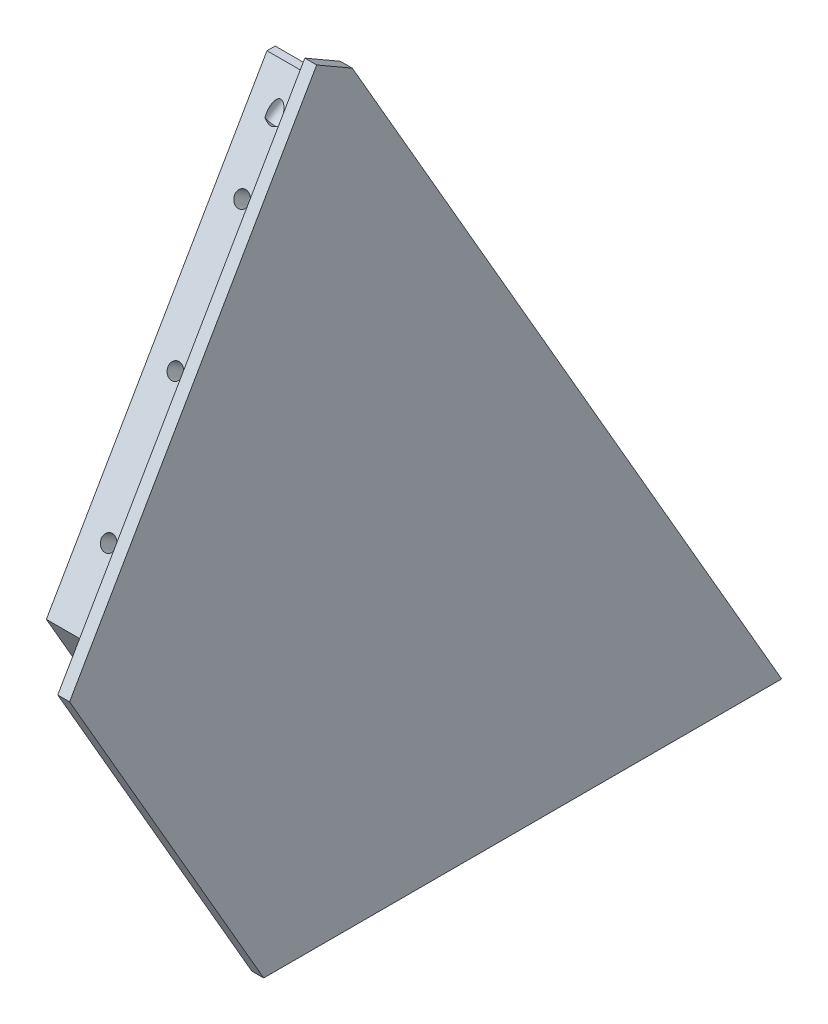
ISO-10303-21;
HEADER;
FILE_DESCRIPTION(('STEP AP214'),'2;1');
FILE_NAME('part.step','',(''),(''),'','','');
FILE_SCHEMA(('AUTOMOTIVE_DESIGN { 1 0 10303 214 1 1 1 1 }'));
ENDSEC;
DATA;
#1=APPLICATION_CONTEXT('core data for automotive mechanical design processes');
#2=APPLICATION_PROTOCOL_DEFINITION('international standard','automotive_design',2000,#1);
#3=PRODUCT_CONTEXT('',#1,'mechanical');
#4=PRODUCT('Part','Part','',(#3));
#5=PRODUCT_RELATED_PRODUCT_CATEGORY('part','',(#4));
#6=PRODUCT_DEFINITION_FORMATION('','',#4);
#7=PRODUCT_DEFINITION_CONTEXT('part definition',#1,'design');
#8=PRODUCT_DEFINITION('design','',#6,#7);
#9=PRODUCT_DEFINITION_SHAPE('','',#8);
#10=(LENGTH_UNIT() NAMED_UNIT(*) SI_UNIT(.MILLI.,.METRE.));
#11=(NAMED_UNIT(*) PLANE_ANGLE_UNIT() SI_UNIT($,.RADIAN.));
#12=(NAMED_UNIT(*) SI_UNIT($,.STERADIAN.) SOLID_ANGLE_UNIT());
#13=UNCERTAINTY_MEASURE_WITH_UNIT(LENGTH_MEASURE(1.E-05),#10,'distance_accuracy_value','');
#14=(GEOMETRIC_REPRESENTATION_CONTEXT(3) GLOBAL_UNCERTAINTY_ASSIGNED_CONTEXT((#13)) GLOBAL_UNIT_ASSIGNED_CONTEXT((#10,
#11,#12)) REPRESENTATION_CONTEXT('',''));
#15=CARTESIAN_POINT('',(0.,0.,0.));
#16=DIRECTION('',(0.,0.,1.));
#17=DIRECTION('',(1.,0.,0.));
#18=AXIS2_PLACEMENT_3D('',#15,#16,#17);
#19=CARTESIAN_POINT('',(10.,124.114736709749,21.8730669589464));
#20=DIRECTION('',(0.,-0.500000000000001,-0.866025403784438));
#21=DIRECTION('',(0.,0.866025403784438,-0.500000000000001));
#22=AXIS2_PLACEMENT_3D('',#19,#20,#21);
#23=PLANE('',#22);
#24=CARTESIAN_POINT('',(5.75019999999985,116.823079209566,26.0829073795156));
#25=CARTESIAN_POINT('',(5.69529418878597,116.792530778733,26.1005445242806));
#26=CARTESIAN_POINT('',(5.64016045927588,116.76226922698,26.1180160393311));
#27=CARTESIAN_POINT('',(5.52906065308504,116.702688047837,26.1524152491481));
#28=CARTESIAN_POINT('',(5.4730930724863,116.67337053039,26.1693417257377));
#29=CARTESIAN_POINT('',(5.357929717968,116.615038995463,26.20301945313));
#30=CARTESIAN_POINT('',(5.29869412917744,116.586083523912,26.219736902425));
#31=CARTESIAN_POINT('',(5.17872310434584,116.530650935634,26.2517409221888));
#32=CARTESIAN_POINT('',(5.117989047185,116.504171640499,26.2670287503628));
#33=CARTESIAN_POINT('',(5.02416285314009,116.467106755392,26.2884281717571));
#34=CARTESIAN_POINT('',(4.99186883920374,116.455015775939,26.2954089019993));
#35=CARTESIAN_POINT('',(4.92658541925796,116.432294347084,26.3085271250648));
#36=CARTESIAN_POINT('',(4.89359586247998,116.421664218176,26.3146644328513));
#37=CARTESIAN_POINT('',(4.82719456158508,116.402412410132,26.3257794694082));
#38=CARTESIAN_POINT('',(4.79379019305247,116.393771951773,26.3307680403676));
#39=CARTESIAN_POINT('',(4.72628572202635,116.378897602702,26.3393557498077));
#40=CARTESIAN_POINT('',(4.69218623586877,116.37266167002,26.3429560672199));
#41=CARTESIAN_POINT('',(4.62908262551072,116.363887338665,26.3480219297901));
#42=CARTESIAN_POINT('',(4.60016080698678,116.360910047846,26.349740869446));
#43=CARTESIAN_POINT('',(4.54212571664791,116.357202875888,26.3518812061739));
#44=CARTESIAN_POINT('',(4.51301247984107,116.356472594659,26.3523028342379));
#45=CARTESIAN_POINT('',(4.45480775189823,116.357316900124,26.3518153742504));
#46=CARTESIAN_POINT('',(4.42571629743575,116.358893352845,26.3509052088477));
#47=CARTESIAN_POINT('',(4.36780453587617,116.364232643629,26.3478225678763));
#48=CARTESIAN_POINT('',(4.33898428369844,116.367995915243,26.3456498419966));
#49=CARTESIAN_POINT('',(4.22535372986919,116.386784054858,26.3348025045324));
#50=CARTESIAN_POINT('',(4.142213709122,116.409381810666,26.3217556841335));
#51=CARTESIAN_POINT('',(4.02062007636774,116.450322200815,26.2981187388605));
#52=CARTESIAN_POINT('',(3.98038208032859,116.465251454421,26.2894993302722));
#53=CARTESIAN_POINT('',(3.90079689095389,116.496815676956,26.2712757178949));
#54=CARTESIAN_POINT('',(3.86144938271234,116.513450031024,26.261671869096));
#55=CARTESIAN_POINT('',(3.77238044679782,116.552847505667,26.2389257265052));
#56=CARTESIAN_POINT('',(3.72289749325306,116.576006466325,26.2255548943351));
#57=CARTESIAN_POINT('',(3.62479782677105,116.623680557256,26.1980302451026));
#58=CARTESIAN_POINT('',(3.57618135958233,116.648196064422,26.1838762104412));
#59=CARTESIAN_POINT('',(3.48100493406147,116.697439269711,26.1554456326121));
#60=CARTESIAN_POINT('',(3.4344262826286,116.722140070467,26.1411846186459));
#61=CARTESIAN_POINT('',(3.34177672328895,116.772181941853,26.1122929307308));
#62=CARTESIAN_POINT('',(3.2957054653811,116.797522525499,26.0976625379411));
#63=CARTESIAN_POINT('',(3.24980000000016,116.823079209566,26.0829073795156));
#64=B_SPLINE_CURVE_WITH_KNOTS('',3,(#24,#25,#26,#27,#28,#29,#30,#31,#32,#33,#34,#35,#36,#37,#38,
#39,#40,#41,#42,#43,#44,#45,#46,#47,#48,#49,#50,#51,#52,#53,#54,#55,#56,#57,#58,#59,#60,#61,#62,
#63),.UNSPECIFIED.,.F.,.F.,(4,2,2,2,2,2,2,2,2,2,2,2,2,2,2,2,2,2,2,4),(0.,0.195800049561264,
0.39201099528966,0.596033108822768,0.799874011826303,0.905387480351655,1.01092406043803,
1.11541950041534,1.21982600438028,1.30709604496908,1.39435054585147,1.48167567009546,
1.56901811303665,1.82861033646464,1.95995330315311,2.0912490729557,2.25995367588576,
2.42870538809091,2.59255027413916,2.75627399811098),.UNSPECIFIED.);
#65=CARTESIAN_POINT('',(5.72827212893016,116.810889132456,26.0899453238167));
#66=VERTEX_POINT('',#65);
#67=CARTESIAN_POINT('',(3.27172787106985,116.810889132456,26.0899453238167));
#68=VERTEX_POINT('',#67);
#69=EDGE_CURVE('E42',#66,#68,#64,.T.);
#70=ORIENTED_EDGE('',*,*,#69,.T.);
#71=CARTESIAN_POINT('',(4.5,117.212812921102,25.8578945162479));
#72=DIRECTION('',(0.,-0.500000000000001,-0.866025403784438));
#73=DIRECTION('',(0.,0.866025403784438,-0.500000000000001));
#74=AXIS2_PLACEMENT_3D('',#71,#72,#73);
#75=ELLIPSE('',#74,2.49999999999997,1.24999999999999);
#76=EDGE_CURVE('E11',#68,#66,#75,.T.);
#77=ORIENTED_EDGE('',*,*,#76,.T.);
#78=EDGE_LOOP('',(#70,#77));
#79=FACE_BOUND('',#78,.T.);
#80=CARTESIAN_POINT('',(4.5,108.052558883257,31.1465696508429));
#81=DIRECTION('',(0.,0.500000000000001,0.866025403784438));
#82=DIRECTION('',(0.,-0.866025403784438,0.500000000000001));
#83=AXIS2_PLACEMENT_3D('',#80,#81,#82);
#84=CIRCLE('',#83,1.24999999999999);
#85=CARTESIAN_POINT('',(4.5,106.970027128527,31.7715696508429));
#86=VERTEX_POINT('',#85);
#87=EDGE_CURVE('E230',#86,#86,#84,.T.);
#88=ORIENTED_EDGE('',*,*,#87,.F.);
#89=EDGE_LOOP('',(#88));
#90=FACE_BOUND('',#89,.T.);
#91=DIRECTION('',(0.,-0.866025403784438,0.500000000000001));
#92=VECTOR('',#91,1.);
#93=CARTESIAN_POINT('',(10.,124.114736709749,21.8730669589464));
#94=LINE('',#93,#92);
#95=CARTESIAN_POINT('',(10.,123.114736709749,22.450417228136));
#96=VERTEX_POINT('',#95);
#97=CARTESIAN_POINT('',(10.,58.6891108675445,59.646569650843));
#98=VERTEX_POINT('',#97);
#99=EDGE_CURVE('E235',#96,#98,#94,.T.);
#100=ORIENTED_EDGE('',*,*,#99,.F.);
#101=DIRECTION('',(-1.,0.,0.));
#102=VECTOR('',#101,1.);
#103=CARTESIAN_POINT('',(10.,123.114736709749,22.450417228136));
#104=LINE('',#103,#102);
#105=CARTESIAN_POINT('',(0.,123.114736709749,22.450417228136));
#106=VERTEX_POINT('',#105);
#107=EDGE_CURVE('E290',#96,#106,#104,.T.);
#108=ORIENTED_EDGE('',*,*,#107,.T.);
#109=DIRECTION('',(0.,-0.866025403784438,0.500000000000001));
#110=VECTOR('',#109,1.);
#111=CARTESIAN_POINT('',(0.,124.114736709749,21.8730669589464));
#112=LINE('',#111,#110);
#113=CARTESIAN_POINT('',(0.,58.6891108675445,59.646569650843));
#114=VERTEX_POINT('',#113);
#115=EDGE_CURVE('E346',#106,#114,#112,.T.);
#116=ORIENTED_EDGE('',*,*,#115,.T.);
#117=DIRECTION('',(-1.,0.,0.));
#118=VECTOR('',#117,1.);
#119=CARTESIAN_POINT('',(10.,58.6891108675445,59.646569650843));
#120=LINE('',#119,#118);
#121=EDGE_CURVE('E357',#98,#114,#120,.T.);
#122=ORIENTED_EDGE('',*,*,#121,.F.);
#123=EDGE_LOOP('',(#100,#108,#116,#122));
#124=FACE_BOUND('',#123,.T.);
#125=CARTESIAN_POINT('',(4.5,88.5669872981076,42.396569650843));
#126=DIRECTION('',(0.,0.500000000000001,0.866025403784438));
#127=DIRECTION('',(0.,-0.866025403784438,0.500000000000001));
#128=AXIS2_PLACEMENT_3D('',#125,#126,#127);
#129=CIRCLE('',#128,1.24999999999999);
#130=CARTESIAN_POINT('',(4.5,87.4844555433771,43.021569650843));
#131=VERTEX_POINT('',#130);
#132=EDGE_CURVE('E239',#131,#131,#129,.T.);
#133=ORIENTED_EDGE('',*,*,#132,.F.);
#134=EDGE_LOOP('',(#133));
#135=FACE_BOUND('',#134,.T.);
#136=CARTESIAN_POINT('',(4.5,69.0814157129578,53.646569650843));
#137=DIRECTION('',(0.,0.500000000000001,0.866025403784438));
#138=DIRECTION('',(0.,-0.866025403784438,0.500000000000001));
#139=AXIS2_PLACEMENT_3D('',#136,#137,#138);
#140=CIRCLE('',#139,1.24999999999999);
#141=CARTESIAN_POINT('',(4.5,67.9988839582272,54.271569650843));
#142=VERTEX_POINT('',#141);
#143=EDGE_CURVE('E242',#142,#142,#140,.T.);
#144=ORIENTED_EDGE('',*,*,#143,.F.);
#145=EDGE_LOOP('',(#144));
#146=FACE_BOUND('',#145,.T.);
#147=ADVANCED_FACE('F34',(#79,#90,#124,#135,#146),#23,.F.);
#148=CARTESIAN_POINT('',(10.,58.6891108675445,59.646569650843));
#149=DIRECTION('',(0.,0.500000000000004,-0.866025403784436));
#150=DIRECTION('',(0.,0.866025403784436,0.500000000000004));
#151=AXIS2_PLACEMENT_3D('',#148,#149,#150);
#152=PLANE('',#151);
#153=CARTESIAN_POINT('',(4.5,48.7031939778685,53.8811978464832));
#154=DIRECTION('',(0.,-0.500000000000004,0.866025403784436));
#155=DIRECTION('',(0.,-0.866025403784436,-0.500000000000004));
#156=AXIS2_PLACEMENT_3D('',#153,#154,#155);
#157=CIRCLE('',#156,1.54999999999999);
#158=CARTESIAN_POINT('',(4.5,47.3608546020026,53.1061978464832));
#159=VERTEX_POINT('',#158);
#160=EDGE_CURVE('E263',#159,#159,#157,.T.);
#161=ORIENTED_EDGE('',*,*,#160,.F.);
#162=EDGE_LOOP('',(#161));
#163=FACE_BOUND('',#162,.T.);
#164=DIRECTION('',(0.,-0.866025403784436,-0.500000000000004));
#165=VECTOR('',#164,1.);
#166=CARTESIAN_POINT('',(0.,58.6891108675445,59.646569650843));
#167=LINE('',#166,#165);
#168=CARTESIAN_POINT('',(0.,7.99999999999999,30.381197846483));
#169=VERTEX_POINT('',#168);
#170=EDGE_CURVE('E351',#114,#169,#167,.T.);
#171=ORIENTED_EDGE('',*,*,#170,.T.);
#172=DIRECTION('',(1.,0.,0.));
#173=VECTOR('',#172,1.);
#174=CARTESIAN_POINT('',(10.,8.,30.381197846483));
#175=LINE('',#174,#173);
#176=CARTESIAN_POINT('',(10.,7.99999999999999,30.381197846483));
#177=VERTEX_POINT('',#176);
#178=EDGE_CURVE('E404',#169,#177,#175,.T.);
#179=ORIENTED_EDGE('',*,*,#178,.T.);
#180=DIRECTION('',(0.,-0.866025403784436,-0.500000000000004));
#181=VECTOR('',#180,1.);
#182=CARTESIAN_POINT('',(10.,58.6891108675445,59.646569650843));
#183=LINE('',#182,#181);
#184=EDGE_CURVE('E350',#98,#177,#183,.T.);
#185=ORIENTED_EDGE('',*,*,#184,.F.);
#186=ORIENTED_EDGE('',*,*,#121,.T.);
#187=EDGE_LOOP('',(#171,#179,#185,#186));
#188=FACE_BOUND('',#187,.T.);
#189=CARTESIAN_POINT('',(4.5,18.3923048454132,36.3811978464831));
#190=DIRECTION('',(0.,-0.500000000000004,0.866025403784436));
#191=DIRECTION('',(0.,-0.866025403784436,-0.500000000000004));
#192=AXIS2_PLACEMENT_3D('',#189,#190,#191);
#193=CIRCLE('',#192,1.54999999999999);
#194=CARTESIAN_POINT('',(4.5,17.0499654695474,35.6061978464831));
#195=VERTEX_POINT('',#194);
#196=EDGE_CURVE('E257',#195,#195,#193,.T.);
#197=ORIENTED_EDGE('',*,*,#196,.F.);
#198=EDGE_LOOP('',(#197));
#199=FACE_BOUND('',#198,.T.);
#200=ADVANCED_FACE('F225',(#163,#188,#199),#152,.F.);
#201=CARTESIAN_POINT('',(12.,102.,41.5692193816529));
#202=DIRECTION('',(0.,-0.499999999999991,-0.866025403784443));
#203=DIRECTION('',(0.,0.866025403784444,-0.499999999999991));
#204=AXIS2_PLACEMENT_3D('',#201,#202,#203);
#205=PLANE('',#204);
#206=DIRECTION('',(0.,0.86602540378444,-0.499999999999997));
#207=VECTOR('',#206,1.);
#208=CARTESIAN_POINT('',(10.,128.846787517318,26.069219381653));
#209=LINE('',#208,#207);
#210=CARTESIAN_POINT('',(10.,56.6891108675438,67.7294734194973));
#211=VERTEX_POINT('',#210);
#212=CARTESIAN_POINT('',(10.,128.846787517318,26.069219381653));
#213=VERTEX_POINT('',#212);
#214=EDGE_CURVE('E374',#211,#213,#209,.T.);
#215=ORIENTED_EDGE('',*,*,#214,.F.);
#216=DIRECTION('',(-1.,0.,0.));
#217=VECTOR('',#216,1.);
#218=CARTESIAN_POINT('',(12.,56.6891108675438,67.7294734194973));
#219=LINE('',#218,#217);
#220=CARTESIAN_POINT('',(12.,56.6891108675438,67.7294734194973));
#221=VERTEX_POINT('',#220);
#222=EDGE_CURVE('E398',#221,#211,#219,.T.);
#223=ORIENTED_EDGE('',*,*,#222,.F.);
#224=DIRECTION('',(0.,-0.86602540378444,0.499999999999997));
#225=VECTOR('',#224,1.);
#226=CARTESIAN_POINT('',(12.,102.,41.5692193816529));
#227=LINE('',#226,#225);
#228=CARTESIAN_POINT('',(12.,128.846787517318,26.069219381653));
#229=VERTEX_POINT('',#228);
#230=EDGE_CURVE('E390',#229,#221,#227,.T.);
#231=ORIENTED_EDGE('',*,*,#230,.F.);
#232=DIRECTION('',(1.,0.,0.));
#233=VECTOR('',#232,1.);
#234=CARTESIAN_POINT('',(0.,128.846787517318,26.069219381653));
#235=LINE('',#234,#233);
#236=EDGE_CURVE('E380',#213,#229,#235,.T.);
#237=ORIENTED_EDGE('',*,*,#236,.F.);
#238=EDGE_LOOP('',(#215,#223,#231,#237));
#239=FACE_BOUND('',#238,.T.);
#240=ADVANCED_FACE('F580',(#239),#205,.F.);
#241=CARTESIAN_POINT('',(12.,0.,35.));
#242=DIRECTION('',(0.,0.500000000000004,-0.866025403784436));
#243=DIRECTION('',(0.,0.866025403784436,0.500000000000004));
#244=AXIS2_PLACEMENT_3D('',#241,#242,#243);
#245=PLANE('',#244);
#246=DIRECTION('',(0.,0.866025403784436,0.500000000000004));
#247=VECTOR('',#246,1.);
#248=CARTESIAN_POINT('',(10.,0.,35.));
#249=LINE('',#248,#247);
#250=CARTESIAN_POINT('',(10.,0.,35.));
#251=VERTEX_POINT('',#250);
#252=EDGE_CURVE('E354',#251,#211,#249,.T.);
#253=ORIENTED_EDGE('',*,*,#252,.F.);
#254=DIRECTION('',(-1.,0.,0.));
#255=VECTOR('',#254,1.);
#256=CARTESIAN_POINT('',(12.,0.,35.));
#257=LINE('',#256,#255);
#258=CARTESIAN_POINT('',(12.,0.,35.));
#259=VERTEX_POINT('',#258);
#260=EDGE_CURVE('E395',#259,#251,#257,.T.);
#261=ORIENTED_EDGE('',*,*,#260,.F.);
#262=DIRECTION('',(0.,-0.866025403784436,-0.500000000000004));
#263=VECTOR('',#262,1.);
#264=CARTESIAN_POINT('',(12.,0.,35.));
#265=LINE('',#264,#263);
#266=EDGE_CURVE('E392',#221,#259,#265,.T.);
#267=ORIENTED_EDGE('',*,*,#266,.F.);
#268=ORIENTED_EDGE('',*,*,#222,.T.);
#269=EDGE_LOOP('',(#253,#261,#267,#268));
#270=FACE_BOUND('',#269,.T.);
#271=ADVANCED_FACE('F585',(#270),#245,.F.);
#272=CARTESIAN_POINT('',(12.,132.310889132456,24.069219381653));
#273=DIRECTION('',(0.,-0.499999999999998,0.86602540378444));
#274=DIRECTION('',(0.,-0.86602540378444,-0.499999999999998));
#275=AXIS2_PLACEMENT_3D('',#272,#273,#274);
#276=PLANE('',#275);
#277=DIRECTION('',(-1.,0.,0.));
#278=VECTOR('',#277,1.);
#279=CARTESIAN_POINT('',(12.,0.,-52.3205080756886));
#280=LINE('',#279,#278);
#281=CARTESIAN_POINT('',(12.,0.,-52.3205080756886));
#282=VERTEX_POINT('',#281);
#283=CARTESIAN_POINT('',(10.,0.,-52.3205080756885));
#284=VERTEX_POINT('',#283);
#285=EDGE_CURVE('E401',#282,#284,#280,.T.);
#286=ORIENTED_EDGE('',*,*,#285,.T.);
#287=DIRECTION('',(0.,-0.86602540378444,-0.499999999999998));
#288=VECTOR('',#287,1.);
#289=CARTESIAN_POINT('',(10.,0.,-52.3205080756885));
#290=LINE('',#289,#288);
#291=CARTESIAN_POINT('',(10.,125.38268590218,20.0692193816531));
#292=VERTEX_POINT('',#291);
#293=EDGE_CURVE('E366',#292,#284,#290,.T.);
#294=ORIENTED_EDGE('',*,*,#293,.F.);
#295=DIRECTION('',(1.,0.,0.));
#296=VECTOR('',#295,1.);
#297=CARTESIAN_POINT('',(0.,125.38268590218,20.0692193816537));
#298=LINE('',#297,#296);
#299=CARTESIAN_POINT('',(12.,125.38268590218,20.0692193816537));
#300=VERTEX_POINT('',#299);
#301=EDGE_CURVE('E381',#292,#300,#298,.T.);
#302=ORIENTED_EDGE('',*,*,#301,.T.);
#303=DIRECTION('',(0.,0.86602540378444,0.499999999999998));
#304=VECTOR('',#303,1.);
#305=CARTESIAN_POINT('',(12.,132.310889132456,24.069219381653));
#306=LINE('',#305,#304);
#307=EDGE_CURVE('E387',#282,#300,#306,.T.);
#308=ORIENTED_EDGE('',*,*,#307,.F.);
#309=EDGE_LOOP('',(#286,#294,#302,#308));
#310=FACE_BOUND('',#309,.T.);
#311=ADVANCED_FACE('F639',(#310),#276,.F.);
#312=CARTESIAN_POINT('',(12.,0.,35.));
#313=DIRECTION('',(0.,1.,0.));
#314=DIRECTION('',(0.,0.,1.));
#315=AXIS2_PLACEMENT_3D('',#312,#313,#314);
#316=PLANE('',#315);
#317=ORIENTED_EDGE('',*,*,#260,.T.);
#318=DIRECTION('',(0.,0.,1.));
#319=VECTOR('',#318,1.);
#320=CARTESIAN_POINT('',(10.,0.,-45.));
#321=LINE('',#320,#319);
#322=EDGE_CURVE('E369',#284,#251,#321,.T.);
#323=ORIENTED_EDGE('',*,*,#322,.F.);
#324=ORIENTED_EDGE('',*,*,#285,.F.);
#325=DIRECTION('',(0.,0.,-1.));
#326=VECTOR('',#325,1.);
#327=CARTESIAN_POINT('',(12.,0.,0.));
#328=LINE('',#327,#326);
#329=EDGE_CURVE('E383',#259,#282,#328,.T.);
#330=ORIENTED_EDGE('',*,*,#329,.F.);
#331=EDGE_LOOP('',(#317,#323,#324,#330));
#332=FACE_BOUND('',#331,.T.);
#333=ADVANCED_FACE('F686',(#332),#316,.F.);
#334=CARTESIAN_POINT('',(12.,0.,0.));
#335=DIRECTION('',(-1.,0.,0.));
#336=DIRECTION('',(0.,0.,1.));
#337=AXIS2_PLACEMENT_3D('',#334,#335,#336);
#338=PLANE('',#337);
#339=ORIENTED_EDGE('',*,*,#307,.T.);
#340=DIRECTION('',(0.,-0.500000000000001,-0.866025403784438));
#341=VECTOR('',#340,1.);
#342=CARTESIAN_POINT('',(12.,128.846787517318,26.069219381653));
#343=LINE('',#342,#341);
#344=EDGE_CURVE('E376',#229,#300,#343,.T.);
#345=ORIENTED_EDGE('',*,*,#344,.F.);
#346=ORIENTED_EDGE('',*,*,#230,.T.);
#347=ORIENTED_EDGE('',*,*,#266,.T.);
#348=ORIENTED_EDGE('',*,*,#329,.T.);
#349=EDGE_LOOP('',(#339,#345,#346,#347,#348));
#350=FACE_BOUND('',#349,.T.);
#351=ADVANCED_FACE('F678',(#350),#338,.F.);
#352=CARTESIAN_POINT('',(0.,0.,0.));
#353=DIRECTION('',(-1.,0.,0.));
#354=DIRECTION('',(0.,0.,1.));
#355=AXIS2_PLACEMENT_3D('',#352,#353,#354);
#356=PLANE('',#355);
#357=DIRECTION('',(0.,0.,1.));
#358=VECTOR('',#357,1.);
#359=CARTESIAN_POINT('',(0.,123.114736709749,22.450417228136));
#360=LINE('',#359,#358);
#361=CARTESIAN_POINT('',(0.,123.114736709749,21.0692193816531));
#362=VERTEX_POINT('',#361);
#363=EDGE_CURVE('E285',#362,#106,#360,.T.);
#364=ORIENTED_EDGE('',*,*,#363,.F.);
#365=DIRECTION('',(0.,0.86602540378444,0.499999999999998));
#366=VECTOR('',#365,1.);
#367=CARTESIAN_POINT('',(0.,123.918584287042,21.5333209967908));
#368=LINE('',#367,#366);
#369=CARTESIAN_POINT('',(0.,118.671123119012,18.5036978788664));
#370=VERTEX_POINT('',#369);
#371=EDGE_CURVE('E363',#370,#362,#368,.T.);
#372=ORIENTED_EDGE('',*,*,#371,.F.);
#373=DIRECTION('',(0.,0.499999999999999,-0.866025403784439));
#374=VECTOR('',#373,1.);
#375=CARTESIAN_POINT('',(0.,119.671123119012,16.7716470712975));
#376=LINE('',#375,#374);
#377=CARTESIAN_POINT('',(0.,117.016123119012,21.3702419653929));
#378=VERTEX_POINT('',#377);
#379=EDGE_CURVE('E308',#378,#370,#376,.T.);
#380=ORIENTED_EDGE('',*,*,#379,.F.);
#381=CARTESIAN_POINT('',(0.,112.68599610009,18.8702419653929));
#382=DIRECTION('',(-1.,0.,0.));
#383=DIRECTION('',(0.,0.,1.));
#384=AXIS2_PLACEMENT_3D('',#381,#382,#383);
#385=CIRCLE('',#384,5.);
#386=CARTESIAN_POINT('',(0.,110.18599610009,23.2003689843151));
#387=VERTEX_POINT('',#386);
#388=EDGE_CURVE('E432',#378,#387,#385,.F.);
#389=ORIENTED_EDGE('',*,*,#388,.T.);
#390=DIRECTION('',(0.,0.866025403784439,0.5));
#391=VECTOR('',#390,1.);
#392=CARTESIAN_POINT('',(0.,114.516123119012,25.7003689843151));
#393=LINE('',#392,#391);
#394=CARTESIAN_POINT('',(0.,36.5738367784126,-19.2996310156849));
#395=VERTEX_POINT('',#394);
#396=EDGE_CURVE('E316',#395,#387,#393,.T.);
#397=ORIENTED_EDGE('',*,*,#396,.F.);
#398=CARTESIAN_POINT('',(0.,39.0738367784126,-23.6297580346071));
#399=DIRECTION('',(-1.,0.,0.));
#400=DIRECTION('',(0.,0.,1.));
#401=AXIS2_PLACEMENT_3D('',#398,#399,#400);
#402=CIRCLE('',#401,5.);
#403=CARTESIAN_POINT('',(0.,34.7437097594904,-26.1297580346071));
#404=VERTEX_POINT('',#403);
#405=EDGE_CURVE('E430',#395,#404,#402,.F.);
#406=ORIENTED_EDGE('',*,*,#405,.T.);
#407=DIRECTION('',(0.,-0.5,0.866025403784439));
#408=VECTOR('',#407,1.);
#409=CARTESIAN_POINT('',(0.,32.2437097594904,-21.7996310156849));
#410=LINE('',#409,#408);
#411=CARTESIAN_POINT('',(0.,36.3987097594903,-28.9963021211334));
#412=VERTEX_POINT('',#411);
#413=EDGE_CURVE('E302',#412,#404,#410,.T.);
#414=ORIENTED_EDGE('',*,*,#413,.F.);
#415=CARTESIAN_POINT('',(0.,10.4115427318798,-44.));
#416=VERTEX_POINT('',#415);
#417=EDGE_CURVE('E367',#416,#412,#368,.T.);
#418=ORIENTED_EDGE('',*,*,#417,.F.);
#419=DIRECTION('',(0.,1.,0.));
#420=VECTOR('',#419,1.);
#421=CARTESIAN_POINT('',(0.,7.99999999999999,-44.));
#422=LINE('',#421,#420);
#423=CARTESIAN_POINT('',(0.,7.99999999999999,-44.));
#424=VERTEX_POINT('',#423);
#425=EDGE_CURVE('E292',#424,#416,#422,.T.);
#426=ORIENTED_EDGE('',*,*,#425,.F.);
#427=DIRECTION('',(0.,0.,-1.));
#428=VECTOR('',#427,1.);
#429=CARTESIAN_POINT('',(0.,8.,-45.));
#430=LINE('',#429,#428);
#431=EDGE_CURVE('E333',#169,#424,#430,.T.);
#432=ORIENTED_EDGE('',*,*,#431,.F.);
#433=ORIENTED_EDGE('',*,*,#170,.F.);
#434=ORIENTED_EDGE('',*,*,#115,.F.);
#435=EDGE_LOOP('',(#364,#372,#380,#389,#397,#406,#414,#418,#426,#432,#433,#434));
#436=FACE_BOUND('',#435,.T.);
#437=DIRECTION('',(0.,-0.86602540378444,-0.499999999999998));
#438=VECTOR('',#437,1.);
#439=CARTESIAN_POINT('',(0.,106.310889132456,26.3786204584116));
#440=LINE('',#439,#438);
#441=CARTESIAN_POINT('',(0.,95.0608891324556,19.8834299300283));
#442=VERTEX_POINT('',#441);
#443=CARTESIAN_POINT('',(0.,24.25,-20.9992559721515));
#444=VERTEX_POINT('',#443);
#445=EDGE_CURVE('E313',#442,#444,#440,.T.);
#446=ORIENTED_EDGE('',*,*,#445,.F.);
#447=CARTESIAN_POINT('',(0.,91.3108891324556,26.3786204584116));
#448=DIRECTION('',(-1.,0.,0.));
#449=DIRECTION('',(0.,0.,1.));
#450=AXIS2_PLACEMENT_3D('',#447,#448,#449);
#451=CIRCLE('',#450,7.5);
#452=CARTESIAN_POINT('',(0.,95.0608891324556,32.8738109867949));
#453=VERTEX_POINT('',#452);
#454=EDGE_CURVE('E217',#442,#453,#451,.F.);
#455=ORIENTED_EDGE('',*,*,#454,.T.);
#456=DIRECTION('',(0.,0.866025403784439,-0.5));
#457=VECTOR('',#456,1.);
#458=CARTESIAN_POINT('',(0.,106.310889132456,26.3786204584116));
#459=LINE('',#458,#457);
#460=CARTESIAN_POINT('',(0.,62.4391108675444,51.7080034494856));
#461=VERTEX_POINT('',#460);
#462=EDGE_CURVE('E324',#461,#453,#459,.T.);
#463=ORIENTED_EDGE('',*,*,#462,.F.);
#464=CARTESIAN_POINT('',(0.,58.6891108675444,45.2128129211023));
#465=DIRECTION('',(-1.,0.,0.));
#466=DIRECTION('',(0.,0.,1.));
#467=AXIS2_PLACEMENT_3D('',#464,#465,#466);
#468=CIRCLE('',#467,7.5);
#469=CARTESIAN_POINT('',(0.,54.9391108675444,51.7080034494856));
#470=VERTEX_POINT('',#469);
#471=EDGE_CURVE('E464',#461,#470,#468,.F.);
#472=ORIENTED_EDGE('',*,*,#471,.T.);
#473=DIRECTION('',(0.,0.866025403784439,0.5));
#474=VECTOR('',#473,1.);
#475=CARTESIAN_POINT('',(0.,58.6891108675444,53.8730669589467));
#476=LINE('',#475,#474);
#477=CARTESIAN_POINT('',(0.,16.75,29.6595100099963));
#478=VERTEX_POINT('',#477);
#479=EDGE_CURVE('E338',#478,#470,#476,.T.);
#480=ORIENTED_EDGE('',*,*,#479,.F.);
#481=CARTESIAN_POINT('',(0.,20.5,23.164319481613));
#482=DIRECTION('',(-1.,0.,0.));
#483=DIRECTION('',(0.,0.,1.));
#484=AXIS2_PLACEMENT_3D('',#481,#482,#483);
#485=CIRCLE('',#484,7.5);
#486=CARTESIAN_POINT('',(0.,13.,23.164319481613));
#487=VERTEX_POINT('',#486);
#488=EDGE_CURVE('E462',#478,#487,#485,.F.);
#489=ORIENTED_EDGE('',*,*,#488,.T.);
#490=DIRECTION('',(0.,0.,1.));
#491=VECTOR('',#490,1.);
#492=CARTESIAN_POINT('',(0.,13.,27.4944465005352));
#493=LINE('',#492,#491);
#494=CARTESIAN_POINT('',(0.,13.,-14.5040654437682));
#495=VERTEX_POINT('',#494);
#496=EDGE_CURVE('E335',#495,#487,#493,.T.);
#497=ORIENTED_EDGE('',*,*,#496,.F.);
#498=CARTESIAN_POINT('',(0.,20.5,-14.5040654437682));
#499=DIRECTION('',(-1.,0.,0.));
#500=DIRECTION('',(0.,0.,1.));
#501=AXIS2_PLACEMENT_3D('',#498,#499,#500);
#502=CIRCLE('',#501,7.5);
#503=EDGE_CURVE('E56',#495,#444,#502,.F.);
#504=ORIENTED_EDGE('',*,*,#503,.T.);
#505=EDGE_LOOP('',(#446,#455,#463,#472,#480,#489,#497,#504));
#506=FACE_BOUND('',#505,.T.);
#507=ADVANCED_FACE('F599',(#436,#506),#356,.T.);
#508=CARTESIAN_POINT('',(0.,128.846787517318,26.069219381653));
#509=DIRECTION('',(0.,-0.866025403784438,0.500000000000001));
#510=DIRECTION('',(0.,-0.500000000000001,-0.866025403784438));
#511=AXIS2_PLACEMENT_3D('',#508,#509,#510);
#512=PLANE('',#511);
#513=ORIENTED_EDGE('',*,*,#301,.F.);
#514=DIRECTION('',(0.,-0.5,-0.866025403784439));
#515=VECTOR('',#514,1.);
#516=CARTESIAN_POINT('',(10.,125.38268590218,20.0692193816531));
#517=LINE('',#516,#515);
#518=EDGE_CURVE('E364',#213,#292,#517,.T.);
#519=ORIENTED_EDGE('',*,*,#518,.F.);
#520=ORIENTED_EDGE('',*,*,#236,.T.);
#521=ORIENTED_EDGE('',*,*,#344,.T.);
#522=EDGE_LOOP('',(#513,#519,#520,#521));
#523=FACE_BOUND('',#522,.T.);
#524=ADVANCED_FACE('F677',(#523),#512,.F.);
#525=CARTESIAN_POINT('',(10.,123.918584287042,21.5333209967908));
#526=DIRECTION('',(0.,-0.499999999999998,0.86602540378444));
#527=DIRECTION('',(0.,-0.86602540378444,-0.499999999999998));
#528=AXIS2_PLACEMENT_3D('',#525,#526,#527);
#529=PLANE('',#528);
#530=CARTESIAN_POINT('',(4.5,120.761851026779,19.7107801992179));
#531=DIRECTION('',(0.,0.499999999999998,-0.86602540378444));
#532=DIRECTION('',(0.,0.86602540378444,0.499999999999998));
#533=AXIS2_PLACEMENT_3D('',#530,#531,#532);
#534=CIRCLE('',#533,1.24999999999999);
#535=CARTESIAN_POINT('',(4.5,121.844382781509,20.3357801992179));
#536=VERTEX_POINT('',#535);
#537=EDGE_CURVE('E221',#536,#536,#534,.T.);
#538=ORIENTED_EDGE('',*,*,#537,.F.);
#539=EDGE_LOOP('',(#538));
#540=FACE_BOUND('',#539,.T.);
#541=CARTESIAN_POINT('',(4.5,22.0349549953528,-37.2892198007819));
#542=DIRECTION('',(0.,0.499999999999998,-0.86602540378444));
#543=DIRECTION('',(0.,0.86602540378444,0.499999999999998));
#544=AXIS2_PLACEMENT_3D('',#541,#542,#543);
#545=CIRCLE('',#544,1.24999999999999);
#546=CARTESIAN_POINT('',(4.5,23.1174867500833,-36.6642198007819));
#547=VERTEX_POINT('',#546);
#548=EDGE_CURVE('E220',#547,#547,#545,.T.);
#549=ORIENTED_EDGE('',*,*,#548,.F.);
#550=EDGE_LOOP('',(#549));
#551=FACE_BOUND('',#550,.T.);
#552=ORIENTED_EDGE('',*,*,#371,.T.);
#553=DIRECTION('',(-1.,0.,0.));
#554=VECTOR('',#553,1.);
#555=CARTESIAN_POINT('',(10.,123.114736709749,21.0692193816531));
#556=LINE('',#555,#554);
#557=CARTESIAN_POINT('',(10.,123.114736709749,21.0692193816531));
#558=VERTEX_POINT('',#557);
#559=EDGE_CURVE('E288',#558,#362,#556,.T.);
#560=ORIENTED_EDGE('',*,*,#559,.F.);
#561=DIRECTION('',(0.,0.86602540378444,0.499999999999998));
#562=VECTOR('',#561,1.);
#563=CARTESIAN_POINT('',(10.,123.918584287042,21.5333209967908));
#564=LINE('',#563,#562);
#565=CARTESIAN_POINT('',(10.,10.4115427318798,-44.));
#566=VERTEX_POINT('',#565);
#567=EDGE_CURVE('E371',#566,#558,#564,.T.);
#568=ORIENTED_EDGE('',*,*,#567,.F.);
#569=DIRECTION('',(-1.,0.,0.));
#570=VECTOR('',#569,1.);
#571=CARTESIAN_POINT('',(10.,10.4115427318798,-44.));
#572=LINE('',#571,#570);
#573=EDGE_CURVE('E299',#566,#416,#572,.T.);
#574=ORIENTED_EDGE('',*,*,#573,.T.);
#575=ORIENTED_EDGE('',*,*,#417,.T.);
#576=DIRECTION('',(1.,0.,0.));
#577=VECTOR('',#576,1.);
#578=CARTESIAN_POINT('',(10.,36.3987097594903,-28.9963021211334));
#579=LINE('',#578,#577);
#580=CARTESIAN_POINT('',(6.,36.3987097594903,-28.9963021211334));
#581=VERTEX_POINT('',#580);
#582=EDGE_CURVE('E410',#412,#581,#579,.T.);
#583=ORIENTED_EDGE('',*,*,#582,.T.);
#584=DIRECTION('',(0.,0.86602540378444,0.499999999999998));
#585=VECTOR('',#584,1.);
#586=CARTESIAN_POINT('',(6.,123.918584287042,21.5333209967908));
#587=LINE('',#586,#585);
#588=CARTESIAN_POINT('',(6.,118.671123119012,18.5036978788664));
#589=VERTEX_POINT('',#588);
#590=EDGE_CURVE('E407',#581,#589,#587,.T.);
#591=ORIENTED_EDGE('',*,*,#590,.T.);
#592=DIRECTION('',(-1.,0.,0.));
#593=VECTOR('',#592,1.);
#594=CARTESIAN_POINT('',(10.,118.671123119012,18.5036978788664));
#595=LINE('',#594,#593);
#596=EDGE_CURVE('E413',#589,#370,#595,.T.);
#597=ORIENTED_EDGE('',*,*,#596,.T.);
#598=EDGE_LOOP('',(#552,#560,#568,#574,#575,#583,#591,#597));
#599=FACE_BOUND('',#598,.T.);
#600=ADVANCED_FACE('F613',(#540,#551,#599),#529,.F.);
#601=CARTESIAN_POINT('',(10.,0.,0.));
#602=DIRECTION('',(1.,0.,0.));
#603=DIRECTION('',(0.,0.,-1.));
#604=AXIS2_PLACEMENT_3D('',#601,#602,#603);
#605=PLANE('',#604);
#606=ORIENTED_EDGE('',*,*,#567,.T.);
#607=DIRECTION('',(0.,0.,1.));
#608=VECTOR('',#607,1.);
#609=CARTESIAN_POINT('',(10.,123.114736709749,22.450417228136));
#610=LINE('',#609,#608);
#611=EDGE_CURVE('E286',#558,#96,#610,.T.);
#612=ORIENTED_EDGE('',*,*,#611,.T.);
#613=ORIENTED_EDGE('',*,*,#99,.T.);
#614=ORIENTED_EDGE('',*,*,#184,.T.);
#615=DIRECTION('',(0.,0.,-1.));
#616=VECTOR('',#615,1.);
#617=CARTESIAN_POINT('',(10.,8.,-45.));
#618=LINE('',#617,#616);
#619=CARTESIAN_POINT('',(10.,7.99999999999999,-44.));
#620=VERTEX_POINT('',#619);
#621=EDGE_CURVE('E343',#177,#620,#618,.T.);
#622=ORIENTED_EDGE('',*,*,#621,.T.);
#623=DIRECTION('',(0.,1.,0.));
#624=VECTOR('',#623,1.);
#625=CARTESIAN_POINT('',(10.,7.99999999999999,-44.));
#626=LINE('',#625,#624);
#627=EDGE_CURVE('E294',#620,#566,#626,.T.);
#628=ORIENTED_EDGE('',*,*,#627,.T.);
#629=EDGE_LOOP('',(#606,#612,#613,#614,#622,#628));
#630=FACE_BOUND('',#629,.T.);
#631=ORIENTED_EDGE('',*,*,#322,.T.);
#632=ORIENTED_EDGE('',*,*,#252,.T.);
#633=ORIENTED_EDGE('',*,*,#214,.T.);
#634=ORIENTED_EDGE('',*,*,#518,.T.);
#635=ORIENTED_EDGE('',*,*,#293,.T.);
#636=EDGE_LOOP('',(#631,#632,#633,#634,#635));
#637=FACE_BOUND('',#636,.T.);
#638=ADVANCED_FACE('F577',(#630,#637),#605,.F.);
#639=CARTESIAN_POINT('',(10.,8.,-45.));
#640=DIRECTION('',(0.,1.,0.));
#641=DIRECTION('',(0.,0.,1.));
#642=AXIS2_PLACEMENT_3D('',#639,#640,#641);
#643=PLANE('',#642);
#644=CARTESIAN_POINT('',(4.5,8.,20.));
#645=DIRECTION('',(0.,-1.,0.));
#646=DIRECTION('',(0.,0.,-1.));
#647=AXIS2_PLACEMENT_3D('',#644,#645,#646);
#648=CIRCLE('',#647,1.24999999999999);
#649=CARTESIAN_POINT('',(4.5,8.,18.75));
#650=VERTEX_POINT('',#649);
#651=EDGE_CURVE('E269',#650,#650,#648,.T.);
#652=ORIENTED_EDGE('',*,*,#651,.F.);
#653=EDGE_LOOP('',(#652));
#654=FACE_BOUND('',#653,.T.);
#655=CARTESIAN_POINT('',(4.5,8.,-4.99999999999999));
#656=DIRECTION('',(0.,-1.,0.));
#657=DIRECTION('',(0.,0.,-1.));
#658=AXIS2_PLACEMENT_3D('',#655,#656,#657);
#659=CIRCLE('',#658,1.24999999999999);
#660=CARTESIAN_POINT('',(4.5,8.,-6.24999999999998));
#661=VERTEX_POINT('',#660);
#662=EDGE_CURVE('E273',#661,#661,#659,.T.);
#663=ORIENTED_EDGE('',*,*,#662,.F.);
#664=EDGE_LOOP('',(#663));
#665=FACE_BOUND('',#664,.T.);
#666=CARTESIAN_POINT('',(4.5,8.,-35.));
#667=DIRECTION('',(0.,-1.,0.));
#668=DIRECTION('',(0.,0.,-1.));
#669=AXIS2_PLACEMENT_3D('',#666,#667,#668);
#670=CIRCLE('',#669,1.24999999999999);
#671=CARTESIAN_POINT('',(4.5,8.,-36.25));
#672=VERTEX_POINT('',#671);
#673=EDGE_CURVE('E279',#672,#672,#670,.T.);
#674=ORIENTED_EDGE('',*,*,#673,.F.);
#675=EDGE_LOOP('',(#674));
#676=FACE_BOUND('',#675,.T.);
#677=ORIENTED_EDGE('',*,*,#431,.T.);
#678=DIRECTION('',(-1.,0.,0.));
#679=VECTOR('',#678,1.);
#680=CARTESIAN_POINT('',(10.,7.99999999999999,-44.));
#681=LINE('',#680,#679);
#682=EDGE_CURVE('E297',#620,#424,#681,.T.);
#683=ORIENTED_EDGE('',*,*,#682,.F.);
#684=ORIENTED_EDGE('',*,*,#621,.F.);
#685=ORIENTED_EDGE('',*,*,#178,.F.);
#686=EDGE_LOOP('',(#677,#683,#684,#685));
#687=FACE_BOUND('',#686,.T.);
#688=ADVANCED_FACE('F574',(#654,#665,#676,#687),#643,.F.);
#689=CARTESIAN_POINT('',(9.,106.310889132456,26.3786204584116));
#690=DIRECTION('',(0.,0.499999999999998,-0.86602540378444));
#691=DIRECTION('',(0.,0.86602540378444,0.499999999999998));
#692=AXIS2_PLACEMENT_3D('',#689,#690,#691);
#693=PLANE('',#692);
#694=CARTESIAN_POINT('',(2.25000000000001,91.3828547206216,17.7599157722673));
#695=DIRECTION('',(0.,0.499999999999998,-0.86602540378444));
#696=DIRECTION('',(0.,0.86602540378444,0.499999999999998));
#697=AXIS2_PLACEMENT_3D('',#694,#695,#696);
#698=CIRCLE('',#697,1.24999999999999);
#699=CARTESIAN_POINT('',(2.25000000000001,92.4653864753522,18.3849157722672));
#700=VERTEX_POINT('',#699);
#701=EDGE_CURVE('E738',#700,#700,#698,.T.);
#702=ORIENTED_EDGE('',*,*,#701,.T.);
#703=EDGE_LOOP('',(#702));
#704=FACE_BOUND('',#703,.T.);
#705=CARTESIAN_POINT('',(2.25,48.0815845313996,-7.24008422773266));
#706=DIRECTION('',(0.,0.499999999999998,-0.86602540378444));
#707=DIRECTION('',(0.,0.86602540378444,0.499999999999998));
#708=AXIS2_PLACEMENT_3D('',#705,#706,#707);
#709=CIRCLE('',#708,1.24999999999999);
#710=CARTESIAN_POINT('',(2.25,49.1641162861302,-6.61508422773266));
#711=VERTEX_POINT('',#710);
#712=EDGE_CURVE('E732',#711,#711,#709,.T.);
#713=ORIENTED_EDGE('',*,*,#712,.T.);
#714=EDGE_LOOP('',(#713));
#715=FACE_BOUND('',#714,.T.);
#716=ORIENTED_EDGE('',*,*,#445,.T.);
#717=DIRECTION('',(-1.,0.,0.));
#718=VECTOR('',#717,1.);
#719=CARTESIAN_POINT('',(9.,24.25,-20.9992559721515));
#720=LINE('',#719,#718);
#721=CARTESIAN_POINT('',(9.,24.25,-20.9992559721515));
#722=VERTEX_POINT('',#721);
#723=EDGE_CURVE('E460',#444,#722,#720,.F.);
#724=ORIENTED_EDGE('',*,*,#723,.T.);
#725=DIRECTION('',(0.,-0.86602540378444,-0.499999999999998));
#726=VECTOR('',#725,1.);
#727=CARTESIAN_POINT('',(9.,106.310889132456,26.3786204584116));
#728=LINE('',#727,#726);
#729=CARTESIAN_POINT('',(9.,95.0608891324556,19.8834299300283));
#730=VERTEX_POINT('',#729);
#731=EDGE_CURVE('E320',#730,#722,#728,.T.);
#732=ORIENTED_EDGE('',*,*,#731,.F.);
#733=DIRECTION('',(-1.,0.,0.));
#734=VECTOR('',#733,1.);
#735=CARTESIAN_POINT('',(0.,95.0608891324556,19.8834299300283));
#736=LINE('',#735,#734);
#737=EDGE_CURVE('E457',#730,#442,#736,.T.);
#738=ORIENTED_EDGE('',*,*,#737,.T.);
#739=EDGE_LOOP('',(#716,#724,#732,#738));
#740=FACE_BOUND('',#739,.T.);
#741=ADVANCED_FACE('F564',(#704,#715,#740),#693,.F.);
#742=CARTESIAN_POINT('',(9.,106.310889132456,26.3786204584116));
#743=DIRECTION('',(0.,0.5,0.866025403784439));
#744=DIRECTION('',(0.,-0.866025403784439,0.5));
#745=AXIS2_PLACEMENT_3D('',#742,#743,#744);
#746=PLANE('',#745);
#747=CARTESIAN_POINT('',(4.5,66.5814157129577,49.3164426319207));
#748=DIRECTION('',(0.,0.5,0.866025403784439));
#749=DIRECTION('',(0.,-0.866025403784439,0.5));
#750=AXIS2_PLACEMENT_3D('',#747,#748,#749);
#751=CIRCLE('',#750,1.24999999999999);
#752=CARTESIAN_POINT('',(4.5,65.4988839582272,49.9414426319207));
#753=VERTEX_POINT('',#752);
#754=EDGE_CURVE('E244',#753,#753,#751,.T.);
#755=ORIENTED_EDGE('',*,*,#754,.T.);
#756=EDGE_LOOP('',(#755));
#757=FACE_BOUND('',#756,.T.);
#758=CARTESIAN_POINT('',(4.5,86.0669872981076,38.0664426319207));
#759=DIRECTION('',(0.,0.5,0.866025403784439));
#760=DIRECTION('',(0.,-0.866025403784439,0.5));
#761=AXIS2_PLACEMENT_3D('',#758,#759,#760);
#762=CIRCLE('',#761,1.24999999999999);
#763=CARTESIAN_POINT('',(4.5,84.9844555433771,38.6914426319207));
#764=VERTEX_POINT('',#763);
#765=EDGE_CURVE('E254',#764,#764,#762,.T.);
#766=ORIENTED_EDGE('',*,*,#765,.T.);
#767=EDGE_LOOP('',(#766));
#768=FACE_BOUND('',#767,.T.);
#769=DIRECTION('',(0.,0.866025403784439,-0.5));
#770=VECTOR('',#769,1.);
#771=CARTESIAN_POINT('',(9.,106.310889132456,26.3786204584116));
#772=LINE('',#771,#770);
#773=CARTESIAN_POINT('',(9.,62.4391108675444,51.7080034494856));
#774=VERTEX_POINT('',#773);
#775=CARTESIAN_POINT('',(9.,95.0608891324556,32.8738109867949));
#776=VERTEX_POINT('',#775);
#777=EDGE_CURVE('E330',#774,#776,#772,.T.);
#778=ORIENTED_EDGE('',*,*,#777,.F.);
#779=DIRECTION('',(-1.,0.,0.));
#780=VECTOR('',#779,1.);
#781=CARTESIAN_POINT('',(0.,62.4391108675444,51.7080034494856));
#782=LINE('',#781,#780);
#783=EDGE_CURVE('E454',#774,#461,#782,.T.);
#784=ORIENTED_EDGE('',*,*,#783,.T.);
#785=ORIENTED_EDGE('',*,*,#462,.T.);
#786=DIRECTION('',(-1.,0.,0.));
#787=VECTOR('',#786,1.);
#788=CARTESIAN_POINT('',(9.,95.0608891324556,32.8738109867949));
#789=LINE('',#788,#787);
#790=EDGE_CURVE('E452',#453,#776,#789,.F.);
#791=ORIENTED_EDGE('',*,*,#790,.T.);
#792=EDGE_LOOP('',(#778,#784,#785,#791));
#793=FACE_BOUND('',#792,.T.);
#794=ADVANCED_FACE('F560',(#757,#768,#793),#746,.F.);
#795=CARTESIAN_POINT('',(9.,58.6891108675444,53.8730669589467));
#796=DIRECTION('',(0.,-0.5,0.866025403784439));
#797=DIRECTION('',(0.,-0.866025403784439,-0.5));
#798=AXIS2_PLACEMENT_3D('',#795,#796,#797);
#799=PLANE('',#798);
#800=CARTESIAN_POINT('',(4.5,20.8923048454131,32.0510708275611));
#801=DIRECTION('',(0.,-0.5,0.866025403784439));
#802=DIRECTION('',(0.,-0.866025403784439,-0.5));
#803=AXIS2_PLACEMENT_3D('',#800,#801,#802);
#804=CIRCLE('',#803,1.54999999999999);
#805=CARTESIAN_POINT('',(4.5,19.5499654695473,31.2760708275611));
#806=VERTEX_POINT('',#805);
#807=EDGE_CURVE('E260',#806,#806,#804,.T.);
#808=ORIENTED_EDGE('',*,*,#807,.T.);
#809=EDGE_LOOP('',(#808));
#810=FACE_BOUND('',#809,.T.);
#811=CARTESIAN_POINT('',(4.5,51.2031939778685,49.5510708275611));
#812=DIRECTION('',(0.,-0.5,0.866025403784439));
#813=DIRECTION('',(0.,-0.866025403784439,-0.5));
#814=AXIS2_PLACEMENT_3D('',#811,#812,#813);
#815=CIRCLE('',#814,1.54999999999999);
#816=CARTESIAN_POINT('',(4.5,49.8608546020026,48.7760708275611));
#817=VERTEX_POINT('',#816);
#818=EDGE_CURVE('E266',#817,#817,#815,.T.);
#819=ORIENTED_EDGE('',*,*,#818,.T.);
#820=EDGE_LOOP('',(#819));
#821=FACE_BOUND('',#820,.T.);
#822=DIRECTION('',(0.,0.866025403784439,0.5));
#823=VECTOR('',#822,1.);
#824=CARTESIAN_POINT('',(9.,58.6891108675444,53.8730669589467));
#825=LINE('',#824,#823);
#826=CARTESIAN_POINT('',(9.,16.75,29.6595100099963));
#827=VERTEX_POINT('',#826);
#828=CARTESIAN_POINT('',(9.,54.9391108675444,51.7080034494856));
#829=VERTEX_POINT('',#828);
#830=EDGE_CURVE('E327',#827,#829,#825,.T.);
#831=ORIENTED_EDGE('',*,*,#830,.F.);
#832=DIRECTION('',(-1.,0.,0.));
#833=VECTOR('',#832,1.);
#834=CARTESIAN_POINT('',(0.,16.75,29.6595100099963));
#835=LINE('',#834,#833);
#836=EDGE_CURVE('E436',#827,#478,#835,.T.);
#837=ORIENTED_EDGE('',*,*,#836,.T.);
#838=ORIENTED_EDGE('',*,*,#479,.T.);
#839=DIRECTION('',(-1.,0.,0.));
#840=VECTOR('',#839,1.);
#841=CARTESIAN_POINT('',(9.,54.9391108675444,51.7080034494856));
#842=LINE('',#841,#840);
#843=EDGE_CURVE('E434',#470,#829,#842,.F.);
#844=ORIENTED_EDGE('',*,*,#843,.T.);
#845=EDGE_LOOP('',(#831,#837,#838,#844));
#846=FACE_BOUND('',#845,.T.);
#847=ADVANCED_FACE('F563',(#810,#821,#846),#799,.F.);
#848=CARTESIAN_POINT('',(9.,13.,27.4944465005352));
#849=DIRECTION('',(0.,-1.,0.));
#850=DIRECTION('',(0.,0.,-1.));
#851=AXIS2_PLACEMENT_3D('',#848,#849,#850);
#852=PLANE('',#851);
#853=CARTESIAN_POINT('',(4.5,13.,20.));
#854=DIRECTION('',(0.,-1.,0.));
#855=DIRECTION('',(0.,0.,-1.));
#856=AXIS2_PLACEMENT_3D('',#853,#854,#855);
#857=CIRCLE('',#856,1.24999999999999);
#858=CARTESIAN_POINT('',(4.5,13.,18.75));
#859=VERTEX_POINT('',#858);
#860=EDGE_CURVE('E272',#859,#859,#857,.T.);
#861=ORIENTED_EDGE('',*,*,#860,.T.);
#862=EDGE_LOOP('',(#861));
#863=FACE_BOUND('',#862,.T.);
#864=CARTESIAN_POINT('',(4.5,13.,-4.99999999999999));
#865=DIRECTION('',(0.,-1.,0.));
#866=DIRECTION('',(0.,0.,-1.));
#867=AXIS2_PLACEMENT_3D('',#864,#865,#866);
#868=CIRCLE('',#867,1.24999999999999);
#869=CARTESIAN_POINT('',(4.5,13.,-6.24999999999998));
#870=VERTEX_POINT('',#869);
#871=EDGE_CURVE('E276',#870,#870,#868,.T.);
#872=ORIENTED_EDGE('',*,*,#871,.T.);
#873=EDGE_LOOP('',(#872));
#874=FACE_BOUND('',#873,.T.);
#875=ORIENTED_EDGE('',*,*,#496,.T.);
#876=DIRECTION('',(-1.,0.,0.));
#877=VECTOR('',#876,1.);
#878=CARTESIAN_POINT('',(9.,13.,23.164319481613));
#879=LINE('',#878,#877);
#880=CARTESIAN_POINT('',(9.,13.,23.164319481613));
#881=VERTEX_POINT('',#880);
#882=EDGE_CURVE('E442',#487,#881,#879,.F.);
#883=ORIENTED_EDGE('',*,*,#882,.T.);
#884=DIRECTION('',(0.,0.,1.));
#885=VECTOR('',#884,1.);
#886=CARTESIAN_POINT('',(9.,13.,27.4944465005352));
#887=LINE('',#886,#885);
#888=CARTESIAN_POINT('',(9.,13.,-14.5040654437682));
#889=VERTEX_POINT('',#888);
#890=EDGE_CURVE('E323',#889,#881,#887,.T.);
#891=ORIENTED_EDGE('',*,*,#890,.F.);
#892=DIRECTION('',(-1.,0.,0.));
#893=VECTOR('',#892,1.);
#894=CARTESIAN_POINT('',(0.,13.,-14.5040654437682));
#895=LINE('',#894,#893);
#896=EDGE_CURVE('E439',#889,#495,#895,.T.);
#897=ORIENTED_EDGE('',*,*,#896,.T.);
#898=EDGE_LOOP('',(#875,#883,#891,#897));
#899=FACE_BOUND('',#898,.T.);
#900=ADVANCED_FACE('F558',(#863,#874,#899),#852,.F.);
#901=CARTESIAN_POINT('',(9.,0.,0.));
#902=DIRECTION('',(1.,0.,0.));
#903=DIRECTION('',(0.,0.,-1.));
#904=AXIS2_PLACEMENT_3D('',#901,#902,#903);
#905=PLANE('',#904);
#906=ORIENTED_EDGE('',*,*,#890,.T.);
#907=CARTESIAN_POINT('',(9.,20.5,23.164319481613));
#908=DIRECTION('',(1.,0.,0.));
#909=DIRECTION('',(0.,0.,-1.));
#910=AXIS2_PLACEMENT_3D('',#907,#908,#909);
#911=CIRCLE('',#910,7.5);
#912=EDGE_CURVE('E450',#881,#827,#911,.F.);
#913=ORIENTED_EDGE('',*,*,#912,.T.);
#914=ORIENTED_EDGE('',*,*,#830,.T.);
#915=CARTESIAN_POINT('',(9.,58.6891108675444,45.2128129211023));
#916=DIRECTION('',(1.,0.,0.));
#917=DIRECTION('',(0.,0.,-1.));
#918=AXIS2_PLACEMENT_3D('',#915,#916,#917);
#919=CIRCLE('',#918,7.5);
#920=EDGE_CURVE('E448',#829,#774,#919,.F.);
#921=ORIENTED_EDGE('',*,*,#920,.T.);
#922=ORIENTED_EDGE('',*,*,#777,.T.);
#923=CARTESIAN_POINT('',(9.,91.3108891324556,26.3786204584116));
#924=DIRECTION('',(1.,0.,0.));
#925=DIRECTION('',(0.,0.,-1.));
#926=AXIS2_PLACEMENT_3D('',#923,#924,#925);
#927=CIRCLE('',#926,7.5);
#928=EDGE_CURVE('E444',#776,#730,#927,.F.);
#929=ORIENTED_EDGE('',*,*,#928,.T.);
#930=ORIENTED_EDGE('',*,*,#731,.T.);
#931=CARTESIAN_POINT('',(9.,20.5,-14.5040654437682));
#932=DIRECTION('',(1.,0.,0.));
#933=DIRECTION('',(0.,0.,-1.));
#934=AXIS2_PLACEMENT_3D('',#931,#932,#933);
#935=CIRCLE('',#934,7.5);
#936=EDGE_CURVE('E446',#722,#889,#935,.F.);
#937=ORIENTED_EDGE('',*,*,#936,.T.);
#938=EDGE_LOOP('',(#906,#913,#914,#921,#922,#929,#930,#937));
#939=FACE_BOUND('',#938,.T.);
#940=ADVANCED_FACE('F548',(#939),#905,.F.);
#941=CARTESIAN_POINT('',(6.,119.671123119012,16.7716470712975));
#942=DIRECTION('',(0.,0.866025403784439,0.499999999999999));
#943=DIRECTION('',(0.,-0.499999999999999,0.866025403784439));
#944=AXIS2_PLACEMENT_3D('',#941,#942,#943);
#945=PLANE('',#944);
#946=DIRECTION('',(0.,0.499999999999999,-0.866025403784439));
#947=VECTOR('',#946,1.);
#948=CARTESIAN_POINT('',(6.,119.671123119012,16.7716470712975));
#949=LINE('',#948,#947);
#950=CARTESIAN_POINT('',(6.,117.016123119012,21.3702419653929));
#951=VERTEX_POINT('',#950);
#952=EDGE_CURVE('E311',#951,#589,#949,.T.);
#953=ORIENTED_EDGE('',*,*,#952,.F.);
#954=DIRECTION('',(-1.,0.,0.));
#955=VECTOR('',#954,1.);
#956=CARTESIAN_POINT('',(0.,117.016123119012,21.3702419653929));
#957=LINE('',#956,#955);
#958=EDGE_CURVE('E427',#951,#378,#957,.T.);
#959=ORIENTED_EDGE('',*,*,#958,.T.);
#960=ORIENTED_EDGE('',*,*,#379,.T.);
#961=ORIENTED_EDGE('',*,*,#596,.F.);
#962=EDGE_LOOP('',(#953,#959,#960,#961));
#963=FACE_BOUND('',#962,.T.);
#964=ADVANCED_FACE('F545',(#963),#945,.F.);
#965=CARTESIAN_POINT('',(6.,32.2437097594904,-21.7996310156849));
#966=DIRECTION('',(0.,-0.866025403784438,-0.5));
#967=DIRECTION('',(0.,0.5,-0.866025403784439));
#968=AXIS2_PLACEMENT_3D('',#965,#966,#967);
#969=PLANE('',#968);
#970=ORIENTED_EDGE('',*,*,#413,.T.);
#971=DIRECTION('',(-1.,0.,0.));
#972=VECTOR('',#971,1.);
#973=CARTESIAN_POINT('',(6.,34.7437097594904,-26.1297580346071));
#974=LINE('',#973,#972);
#975=CARTESIAN_POINT('',(6.,34.7437097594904,-26.1297580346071));
#976=VERTEX_POINT('',#975);
#977=EDGE_CURVE('E421',#404,#976,#974,.F.);
#978=ORIENTED_EDGE('',*,*,#977,.T.);
#979=DIRECTION('',(0.,-0.5,0.866025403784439));
#980=VECTOR('',#979,1.);
#981=CARTESIAN_POINT('',(6.,32.2437097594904,-21.7996310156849));
#982=LINE('',#981,#980);
#983=EDGE_CURVE('E304',#581,#976,#982,.T.);
#984=ORIENTED_EDGE('',*,*,#983,.F.);
#985=ORIENTED_EDGE('',*,*,#582,.F.);
#986=EDGE_LOOP('',(#970,#978,#984,#985));
#987=FACE_BOUND('',#986,.T.);
#988=ADVANCED_FACE('F543',(#987),#969,.F.);
#989=CARTESIAN_POINT('',(6.,0.,0.));
#990=DIRECTION('',(1.,0.,0.));
#991=DIRECTION('',(0.,0.,-1.));
#992=AXIS2_PLACEMENT_3D('',#989,#990,#991);
#993=PLANE('',#992);
#994=ORIENTED_EDGE('',*,*,#983,.T.);
#995=CARTESIAN_POINT('',(6.,39.0738367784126,-23.6297580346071));
#996=DIRECTION('',(1.,0.,0.));
#997=DIRECTION('',(0.,0.,-1.));
#998=AXIS2_PLACEMENT_3D('',#995,#996,#997);
#999=CIRCLE('',#998,5.);
#1000=CARTESIAN_POINT('',(6.,36.5738367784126,-19.2996310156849));
#1001=VERTEX_POINT('',#1000);
#1002=EDGE_CURVE('E425',#976,#1001,#999,.F.);
#1003=ORIENTED_EDGE('',*,*,#1002,.T.);
#1004=DIRECTION('',(0.,0.866025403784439,0.5));
#1005=VECTOR('',#1004,1.);
#1006=CARTESIAN_POINT('',(6.,114.516123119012,25.7003689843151));
#1007=LINE('',#1006,#1005);
#1008=CARTESIAN_POINT('',(6.,110.18599610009,23.2003689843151));
#1009=VERTEX_POINT('',#1008);
#1010=EDGE_CURVE('E307',#1001,#1009,#1007,.T.);
#1011=ORIENTED_EDGE('',*,*,#1010,.T.);
#1012=CARTESIAN_POINT('',(6.,112.68599610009,18.8702419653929));
#1013=DIRECTION('',(1.,0.,0.));
#1014=DIRECTION('',(0.,0.,-1.));
#1015=AXIS2_PLACEMENT_3D('',#1012,#1013,#1014);
#1016=CIRCLE('',#1015,5.);
#1017=EDGE_CURVE('E423',#1009,#951,#1016,.F.);
#1018=ORIENTED_EDGE('',*,*,#1017,.T.);
#1019=ORIENTED_EDGE('',*,*,#952,.T.);
#1020=ORIENTED_EDGE('',*,*,#590,.F.);
#1021=EDGE_LOOP('',(#994,#1003,#1011,#1018,#1019,#1020));
#1022=FACE_BOUND('',#1021,.T.);
#1023=ADVANCED_FACE('F540',(#1022),#993,.F.);
#1024=CARTESIAN_POINT('',(6.,114.516123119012,25.7003689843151));
#1025=DIRECTION('',(0.,-0.5,0.866025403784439));
#1026=DIRECTION('',(0.,-0.866025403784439,-0.5));
#1027=AXIS2_PLACEMENT_3D('',#1024,#1025,#1026);
#1028=PLANE('',#1027);
#1029=CARTESIAN_POINT('',(2.25000000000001,93.7278547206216,13.6982566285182));
#1030=DIRECTION('',(0.,0.5,-0.866025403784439));
#1031=DIRECTION('',(0.,0.866025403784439,0.5));
#1032=AXIS2_PLACEMENT_3D('',#1029,#1030,#1031);
#1033=CIRCLE('',#1032,1.24999999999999);
#1034=CARTESIAN_POINT('',(2.25000000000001,94.8103864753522,14.3232566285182));
#1035=VERTEX_POINT('',#1034);
#1036=EDGE_CURVE('E741',#1035,#1035,#1033,.T.);
#1037=ORIENTED_EDGE('',*,*,#1036,.F.);
#1038=EDGE_LOOP('',(#1037));
#1039=FACE_BOUND('',#1038,.T.);
#1040=CARTESIAN_POINT('',(2.25,50.4265845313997,-11.3017433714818));
#1041=DIRECTION('',(0.,0.5,-0.866025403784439));
#1042=DIRECTION('',(0.,0.866025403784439,0.5));
#1043=AXIS2_PLACEMENT_3D('',#1040,#1041,#1042);
#1044=CIRCLE('',#1043,1.24999999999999);
#1045=CARTESIAN_POINT('',(2.25,51.5091162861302,-10.6767433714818));
#1046=VERTEX_POINT('',#1045);
#1047=EDGE_CURVE('E735',#1046,#1046,#1044,.T.);
#1048=ORIENTED_EDGE('',*,*,#1047,.F.);
#1049=EDGE_LOOP('',(#1048));
#1050=FACE_BOUND('',#1049,.T.);
#1051=ORIENTED_EDGE('',*,*,#1010,.F.);
#1052=DIRECTION('',(-1.,0.,0.));
#1053=VECTOR('',#1052,1.);
#1054=CARTESIAN_POINT('',(0.,36.5738367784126,-19.2996310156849));
#1055=LINE('',#1054,#1053);
#1056=EDGE_CURVE('E418',#1001,#395,#1055,.T.);
#1057=ORIENTED_EDGE('',*,*,#1056,.T.);
#1058=ORIENTED_EDGE('',*,*,#396,.T.);
#1059=DIRECTION('',(-1.,0.,0.));
#1060=VECTOR('',#1059,1.);
#1061=CARTESIAN_POINT('',(6.,110.18599610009,23.2003689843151));
#1062=LINE('',#1061,#1060);
#1063=EDGE_CURVE('E416',#387,#1009,#1062,.F.);
#1064=ORIENTED_EDGE('',*,*,#1063,.T.);
#1065=EDGE_LOOP('',(#1051,#1057,#1058,#1064));
#1066=FACE_BOUND('',#1065,.T.);
#1067=ADVANCED_FACE('F538',(#1039,#1050,#1066),#1028,.F.);
#1068=CARTESIAN_POINT('',(10.,7.99999999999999,-44.));
#1069=DIRECTION('',(0.,0.,1.));
#1070=DIRECTION('',(1.,0.,0.));
#1071=AXIS2_PLACEMENT_3D('',#1068,#1069,#1070);
#1072=PLANE('',#1071);
#1073=ORIENTED_EDGE('',*,*,#425,.T.);
#1074=ORIENTED_EDGE('',*,*,#573,.F.);
#1075=ORIENTED_EDGE('',*,*,#627,.F.);
#1076=ORIENTED_EDGE('',*,*,#682,.T.);
#1077=EDGE_LOOP('',(#1073,#1074,#1075,#1076));
#1078=FACE_BOUND('',#1077,.T.);
#1079=ADVANCED_FACE('F534',(#1078),#1072,.F.);
#1080=CARTESIAN_POINT('',(10.,123.114736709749,22.450417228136));
#1081=DIRECTION('',(0.,-1.,0.));
#1082=DIRECTION('',(0.,0.,-1.));
#1083=AXIS2_PLACEMENT_3D('',#1080,#1081,#1082);
#1084=PLANE('',#1083);
#1085=ORIENTED_EDGE('',*,*,#363,.T.);
#1086=ORIENTED_EDGE('',*,*,#107,.F.);
#1087=ORIENTED_EDGE('',*,*,#611,.F.);
#1088=ORIENTED_EDGE('',*,*,#559,.T.);
#1089=EDGE_LOOP('',(#1085,#1086,#1087,#1088));
#1090=FACE_BOUND('',#1089,.T.);
#1091=ADVANCED_FACE('F530',(#1090),#1084,.F.);
#1092=CARTESIAN_POINT('',(6.,39.0738367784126,-23.6297580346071));
#1093=DIRECTION('',(1.,0.,0.));
#1094=DIRECTION('',(0.,0.,-1.));
#1095=AXIS2_PLACEMENT_3D('',#1092,#1093,#1094);
#1096=CYLINDRICAL_SURFACE('',#1095,5.);
#1097=ORIENTED_EDGE('',*,*,#1002,.F.);
#1098=ORIENTED_EDGE('',*,*,#977,.F.);
#1099=ORIENTED_EDGE('',*,*,#405,.F.);
#1100=ORIENTED_EDGE('',*,*,#1056,.F.);
#1101=EDGE_LOOP('',(#1097,#1098,#1099,#1100));
#1102=FACE_BOUND('',#1101,.T.);
#1103=ADVANCED_FACE('F533',(#1102),#1096,.F.);
#1104=CARTESIAN_POINT('',(6.,112.68599610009,18.8702419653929));
#1105=DIRECTION('',(1.,0.,0.));
#1106=DIRECTION('',(0.,0.,-1.));
#1107=AXIS2_PLACEMENT_3D('',#1104,#1105,#1106);
#1108=CYLINDRICAL_SURFACE('',#1107,5.);
#1109=ORIENTED_EDGE('',*,*,#1017,.F.);
#1110=ORIENTED_EDGE('',*,*,#1063,.F.);
#1111=ORIENTED_EDGE('',*,*,#388,.F.);
#1112=ORIENTED_EDGE('',*,*,#958,.F.);
#1113=EDGE_LOOP('',(#1109,#1110,#1111,#1112));
#1114=FACE_BOUND('',#1113,.T.);
#1115=ADVANCED_FACE('F624',(#1114),#1108,.F.);
#1116=CARTESIAN_POINT('',(9.,20.5,23.164319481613));
#1117=DIRECTION('',(1.,0.,0.));
#1118=DIRECTION('',(0.,0.,-1.));
#1119=AXIS2_PLACEMENT_3D('',#1116,#1117,#1118);
#1120=CYLINDRICAL_SURFACE('',#1119,7.5);
#1121=ORIENTED_EDGE('',*,*,#912,.F.);
#1122=ORIENTED_EDGE('',*,*,#882,.F.);
#1123=ORIENTED_EDGE('',*,*,#488,.F.);
#1124=ORIENTED_EDGE('',*,*,#836,.F.);
#1125=EDGE_LOOP('',(#1121,#1122,#1123,#1124));
#1126=FACE_BOUND('',#1125,.T.);
#1127=ADVANCED_FACE('F636',(#1126),#1120,.F.);
#1128=CARTESIAN_POINT('',(9.,58.6891108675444,45.2128129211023));
#1129=DIRECTION('',(1.,0.,0.));
#1130=DIRECTION('',(0.,0.,-1.));
#1131=AXIS2_PLACEMENT_3D('',#1128,#1129,#1130);
#1132=CYLINDRICAL_SURFACE('',#1131,7.5);
#1133=ORIENTED_EDGE('',*,*,#920,.F.);
#1134=ORIENTED_EDGE('',*,*,#843,.F.);
#1135=ORIENTED_EDGE('',*,*,#471,.F.);
#1136=ORIENTED_EDGE('',*,*,#783,.F.);
#1137=EDGE_LOOP('',(#1133,#1134,#1135,#1136));
#1138=FACE_BOUND('',#1137,.T.);
#1139=ADVANCED_FACE('F643',(#1138),#1132,.F.);
#1140=CARTESIAN_POINT('',(9.,20.5,-14.5040654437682));
#1141=DIRECTION('',(1.,0.,0.));
#1142=DIRECTION('',(0.,0.,-1.));
#1143=AXIS2_PLACEMENT_3D('',#1140,#1141,#1142);
#1144=CYLINDRICAL_SURFACE('',#1143,7.5);
#1145=ORIENTED_EDGE('',*,*,#936,.F.);
#1146=ORIENTED_EDGE('',*,*,#723,.F.);
#1147=ORIENTED_EDGE('',*,*,#503,.F.);
#1148=ORIENTED_EDGE('',*,*,#896,.F.);
#1149=EDGE_LOOP('',(#1145,#1146,#1147,#1148));
#1150=FACE_BOUND('',#1149,.T.);
#1151=ADVANCED_FACE('F646',(#1150),#1144,.F.);
#1152=CARTESIAN_POINT('',(9.,91.3108891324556,26.3786204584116));
#1153=DIRECTION('',(1.,0.,0.));
#1154=DIRECTION('',(0.,0.,-1.));
#1155=AXIS2_PLACEMENT_3D('',#1152,#1153,#1154);
#1156=CYLINDRICAL_SURFACE('',#1155,7.5);
#1157=ORIENTED_EDGE('',*,*,#928,.F.);
#1158=ORIENTED_EDGE('',*,*,#790,.F.);
#1159=ORIENTED_EDGE('',*,*,#454,.F.);
#1160=ORIENTED_EDGE('',*,*,#737,.F.);
#1161=EDGE_LOOP('',(#1157,#1158,#1159,#1160));
#1162=FACE_BOUND('',#1161,.T.);
#1163=ADVANCED_FACE('F36',(#1162),#1156,.F.);
#1164=CARTESIAN_POINT('',(4.5,16.5,-35.));
#1165=DIRECTION('',(0.,-1.,0.));
#1166=DIRECTION('',(0.,0.,-1.));
#1167=AXIS2_PLACEMENT_3D('',#1164,#1165,#1166);
#1168=CONICAL_SURFACE('',#1167,1.24999999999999,1.02974425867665);
#1169=CARTESIAN_POINT('',(4.5,17.2510757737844,-35.));
#1170=VERTEX_POINT('',#1169);
#1171=VERTEX_LOOP('',#1170);
#1172=FACE_BOUND('',#1171,.T.);
#1173=CARTESIAN_POINT('',(4.5,16.5,-35.));
#1174=DIRECTION('',(0.,-1.,0.));
#1175=DIRECTION('',(0.,0.,-1.));
#1176=AXIS2_PLACEMENT_3D('',#1173,#1174,#1175);
#1177=CIRCLE('',#1176,1.24999999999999);
#1178=CARTESIAN_POINT('',(4.5,16.5,-36.25));
#1179=VERTEX_POINT('',#1178);
#1180=EDGE_CURVE('E282',#1179,#1179,#1177,.T.);
#1181=ORIENTED_EDGE('',*,*,#1180,.T.);
#1182=EDGE_LOOP('',(#1181));
#1183=FACE_BOUND('',#1182,.T.);
#1184=ADVANCED_FACE('F525',(#1172,#1183),#1168,.F.);
#1185=CARTESIAN_POINT('',(4.5,8.,-35.));
#1186=DIRECTION('',(0.,-1.,0.));
#1187=DIRECTION('',(0.,0.,-1.));
#1188=AXIS2_PLACEMENT_3D('',#1185,#1186,#1187);
#1189=CYLINDRICAL_SURFACE('',#1188,1.24999999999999);
#1190=ORIENTED_EDGE('',*,*,#1180,.F.);
#1191=EDGE_LOOP('',(#1190));
#1192=FACE_BOUND('',#1191,.T.);
#1193=ORIENTED_EDGE('',*,*,#673,.T.);
#1194=EDGE_LOOP('',(#1193));
#1195=FACE_BOUND('',#1194,.T.);
#1196=ADVANCED_FACE('F521',(#1192,#1195),#1189,.F.);
#1197=CARTESIAN_POINT('',(4.5,8.,-4.99999999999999));
#1198=DIRECTION('',(0.,-1.,0.));
#1199=DIRECTION('',(0.,0.,-1.));
#1200=AXIS2_PLACEMENT_3D('',#1197,#1198,#1199);
#1201=CYLINDRICAL_SURFACE('',#1200,1.24999999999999);
#1202=ORIENTED_EDGE('',*,*,#662,.T.);
#1203=EDGE_LOOP('',(#1202));
#1204=FACE_BOUND('',#1203,.T.);
#1205=ORIENTED_EDGE('',*,*,#871,.F.);
#1206=EDGE_LOOP('',(#1205));
#1207=FACE_BOUND('',#1206,.T.);
#1208=ADVANCED_FACE('F517',(#1204,#1207),#1201,.F.);
#1209=CARTESIAN_POINT('',(4.5,8.,20.));
#1210=DIRECTION('',(0.,-1.,0.));
#1211=DIRECTION('',(0.,0.,-1.));
#1212=AXIS2_PLACEMENT_3D('',#1209,#1210,#1211);
#1213=CYLINDRICAL_SURFACE('',#1212,1.24999999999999);
#1214=ORIENTED_EDGE('',*,*,#651,.T.);
#1215=EDGE_LOOP('',(#1214));
#1216=FACE_BOUND('',#1215,.T.);
#1217=ORIENTED_EDGE('',*,*,#860,.F.);
#1218=EDGE_LOOP('',(#1217));
#1219=FACE_BOUND('',#1218,.T.);
#1220=ADVANCED_FACE('F513',(#1216,#1219),#1213,.F.);
#1221=CARTESIAN_POINT('',(4.5,48.7031939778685,53.8811978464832));
#1222=DIRECTION('',(0.,-0.500000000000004,0.866025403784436));
#1223=DIRECTION('',(0.,-0.866025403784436,-0.500000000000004));
#1224=AXIS2_PLACEMENT_3D('',#1221,#1222,#1223);
#1225=CYLINDRICAL_SURFACE('',#1224,1.54999999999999);
#1226=ORIENTED_EDGE('',*,*,#818,.F.);
#1227=EDGE_LOOP('',(#1226));
#1228=FACE_BOUND('',#1227,.T.);
#1229=ORIENTED_EDGE('',*,*,#160,.T.);
#1230=EDGE_LOOP('',(#1229));
#1231=FACE_BOUND('',#1230,.T.);
#1232=ADVANCED_FACE('F509',(#1228,#1231),#1225,.F.);
#1233=CARTESIAN_POINT('',(4.5,18.3923048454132,36.3811978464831));
#1234=DIRECTION('',(0.,-0.500000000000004,0.866025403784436));
#1235=DIRECTION('',(0.,-0.866025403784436,-0.500000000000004));
#1236=AXIS2_PLACEMENT_3D('',#1233,#1234,#1235);
#1237=CYLINDRICAL_SURFACE('',#1236,1.54999999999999);
#1238=ORIENTED_EDGE('',*,*,#807,.F.);
#1239=EDGE_LOOP('',(#1238));
#1240=FACE_BOUND('',#1239,.T.);
#1241=ORIENTED_EDGE('',*,*,#196,.T.);
#1242=EDGE_LOOP('',(#1241));
#1243=FACE_BOUND('',#1242,.T.);
#1244=ADVANCED_FACE('F505',(#1240,#1243),#1237,.F.);
#1245=CARTESIAN_POINT('',(4.5,88.5669872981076,42.396569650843));
#1246=DIRECTION('',(0.,0.500000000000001,0.866025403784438));
#1247=DIRECTION('',(0.,-0.866025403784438,0.500000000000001));
#1248=AXIS2_PLACEMENT_3D('',#1245,#1246,#1247);
#1249=CYLINDRICAL_SURFACE('',#1248,1.24999999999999);
#1250=ORIENTED_EDGE('',*,*,#765,.F.);
#1251=EDGE_LOOP('',(#1250));
#1252=FACE_BOUND('',#1251,.T.);
#1253=ORIENTED_EDGE('',*,*,#132,.T.);
#1254=EDGE_LOOP('',(#1253));
#1255=FACE_BOUND('',#1254,.T.);
#1256=ADVANCED_FACE('F501',(#1252,#1255),#1249,.F.);
#1257=CARTESIAN_POINT('',(4.5,69.0814157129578,53.646569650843));
#1258=DIRECTION('',(0.,0.500000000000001,0.866025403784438));
#1259=DIRECTION('',(0.,-0.866025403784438,0.500000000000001));
#1260=AXIS2_PLACEMENT_3D('',#1257,#1258,#1259);
#1261=CYLINDRICAL_SURFACE('',#1260,1.24999999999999);
#1262=ORIENTED_EDGE('',*,*,#754,.F.);
#1263=EDGE_LOOP('',(#1262));
#1264=FACE_BOUND('',#1263,.T.);
#1265=ORIENTED_EDGE('',*,*,#143,.T.);
#1266=EDGE_LOOP('',(#1265));
#1267=FACE_BOUND('',#1266,.T.);
#1268=ADVANCED_FACE('F497',(#1264,#1267),#1261,.F.);
#1269=CARTESIAN_POINT('',(4.5,103.802558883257,23.7853537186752));
#1270=DIRECTION('',(0.,0.500000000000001,0.866025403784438));
#1271=DIRECTION('',(0.,-0.866025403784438,0.500000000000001));
#1272=AXIS2_PLACEMENT_3D('',#1269,#1270,#1271);
#1273=CONICAL_SURFACE('',#1272,1.24999999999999,1.02974425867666);
#1274=CARTESIAN_POINT('',(4.5,103.427020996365,23.1349030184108));
#1275=VERTEX_POINT('',#1274);
#1276=VERTEX_LOOP('',#1275);
#1277=FACE_BOUND('',#1276,.T.);
#1278=CARTESIAN_POINT('',(4.5,103.802558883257,23.7853537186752));
#1279=DIRECTION('',(0.,0.500000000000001,0.866025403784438));
#1280=DIRECTION('',(0.,-0.866025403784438,0.500000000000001));
#1281=AXIS2_PLACEMENT_3D('',#1278,#1279,#1280);
#1282=CIRCLE('',#1281,1.24999999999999);
#1283=CARTESIAN_POINT('',(4.5,102.720027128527,24.4103537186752));
#1284=VERTEX_POINT('',#1283);
#1285=EDGE_CURVE('E245',#1284,#1284,#1282,.T.);
#1286=ORIENTED_EDGE('',*,*,#1285,.T.);
#1287=EDGE_LOOP('',(#1286));
#1288=FACE_BOUND('',#1287,.T.);
#1289=ADVANCED_FACE('F493',(#1277,#1288),#1273,.F.);
#1290=CARTESIAN_POINT('',(4.5,108.052558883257,31.1465696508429));
#1291=DIRECTION('',(0.,0.500000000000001,0.866025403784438));
#1292=DIRECTION('',(0.,-0.866025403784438,0.500000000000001));
#1293=AXIS2_PLACEMENT_3D('',#1290,#1291,#1292);
#1294=CYLINDRICAL_SURFACE('',#1293,1.24999999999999);
#1295=ORIENTED_EDGE('',*,*,#1285,.F.);
#1296=EDGE_LOOP('',(#1295));
#1297=FACE_BOUND('',#1296,.T.);
#1298=ORIENTED_EDGE('',*,*,#87,.T.);
#1299=EDGE_LOOP('',(#1298));
#1300=FACE_BOUND('',#1299,.T.);
#1301=ADVANCED_FACE('F489',(#1297,#1300),#1294,.F.);
#1302=CARTESIAN_POINT('',(4.5,18.2849549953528,-30.7940292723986));
#1303=DIRECTION('',(0.,0.499999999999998,-0.86602540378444));
#1304=DIRECTION('',(0.,0.86602540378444,0.499999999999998));
#1305=AXIS2_PLACEMENT_3D('',#1302,#1303,#1304);
#1306=CONICAL_SURFACE('',#1305,1.24999999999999,1.02974425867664);
#1307=CARTESIAN_POINT('',(4.5,17.9094171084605,-30.1435785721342));
#1308=VERTEX_POINT('',#1307);
#1309=VERTEX_LOOP('',#1308);
#1310=FACE_BOUND('',#1309,.T.);
#1311=CARTESIAN_POINT('',(4.5,18.2849549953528,-30.7940292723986));
#1312=DIRECTION('',(0.,0.499999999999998,-0.86602540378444));
#1313=DIRECTION('',(0.,0.86602540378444,0.499999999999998));
#1314=AXIS2_PLACEMENT_3D('',#1311,#1312,#1313);
#1315=CIRCLE('',#1314,1.24999999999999);
#1316=CARTESIAN_POINT('',(4.5,19.3674867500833,-30.1690292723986));
#1317=VERTEX_POINT('',#1316);
#1318=EDGE_CURVE('E725',#1317,#1317,#1315,.T.);
#1319=ORIENTED_EDGE('',*,*,#1318,.T.);
#1320=EDGE_LOOP('',(#1319));
#1321=FACE_BOUND('',#1320,.T.);
#1322=ADVANCED_FACE('F485',(#1310,#1321),#1306,.F.);
#1323=CARTESIAN_POINT('',(4.5,22.0349549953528,-37.2892198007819));
#1324=DIRECTION('',(0.,0.499999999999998,-0.86602540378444));
#1325=DIRECTION('',(0.,0.86602540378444,0.499999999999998));
#1326=AXIS2_PLACEMENT_3D('',#1323,#1324,#1325);
#1327=CYLINDRICAL_SURFACE('',#1326,1.24999999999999);
#1328=CARTESIAN_POINT('',(4.5,19.3674867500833,-30.1690292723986));
#1329=CARTESIAN_POINT('',(4.5,19.4065492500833,-30.2366875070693));
#1330=CARTESIAN_POINT('',(4.5,19.4456117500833,-30.30434574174));
#1331=CARTESIAN_POINT('',(4.5,19.5237367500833,-30.4396622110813));
#1332=CARTESIAN_POINT('',(4.5,19.5627992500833,-30.5073204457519));
#1333=CARTESIAN_POINT('',(4.5,19.6409242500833,-30.6426369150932));
#1334=CARTESIAN_POINT('',(4.5,19.6799867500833,-30.7102951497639));
#1335=CARTESIAN_POINT('',(4.5,19.7581117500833,-30.8456116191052));
#1336=CARTESIAN_POINT('',(4.5,19.7971742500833,-30.9132698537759));
#1337=CARTESIAN_POINT('',(4.5,19.8752992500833,-31.0485863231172));
#1338=CARTESIAN_POINT('',(4.5,19.9143617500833,-31.1162445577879));
#1339=CARTESIAN_POINT('',(4.5,19.9924867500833,-31.2515610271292));
#1340=CARTESIAN_POINT('',(4.5,20.0315492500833,-31.3192192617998));
#1341=CARTESIAN_POINT('',(4.5,20.1096742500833,-31.4545357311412));
#1342=CARTESIAN_POINT('',(4.5,20.1487367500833,-31.5221939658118));
#1343=CARTESIAN_POINT('',(4.5,20.2268617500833,-31.6575104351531));
#1344=CARTESIAN_POINT('',(4.5,20.2659242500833,-31.7251686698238));
#1345=CARTESIAN_POINT('',(4.5,20.3440492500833,-31.8604851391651));
#1346=CARTESIAN_POINT('',(4.5,20.3831117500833,-31.9281433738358));
#1347=CARTESIAN_POINT('',(4.5,20.4612367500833,-32.0634598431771));
#1348=CARTESIAN_POINT('',(4.5,20.5002992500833,-32.1311180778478));
#1349=CARTESIAN_POINT('',(4.5,20.5784242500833,-32.2664345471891));
#1350=CARTESIAN_POINT('',(4.5,20.6174867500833,-32.3340927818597));
#1351=CARTESIAN_POINT('',(4.5,20.6956117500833,-32.469409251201));
#1352=CARTESIAN_POINT('',(4.5,20.7346742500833,-32.5370674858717));
#1353=CARTESIAN_POINT('',(4.5,20.8127992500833,-32.672383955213));
#1354=CARTESIAN_POINT('',(4.5,20.8518617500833,-32.7400421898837));
#1355=CARTESIAN_POINT('',(4.5,20.9299867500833,-32.875358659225));
#1356=CARTESIAN_POINT('',(4.5,20.9690492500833,-32.9430168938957));
#1357=CARTESIAN_POINT('',(4.5,21.0471742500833,-33.078333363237));
#1358=CARTESIAN_POINT('',(4.5,21.0862367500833,-33.1459915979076));
#1359=CARTESIAN_POINT('',(4.5,21.1643617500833,-33.281308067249));
#1360=CARTESIAN_POINT('',(4.5,21.2034242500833,-33.3489663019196));
#1361=CARTESIAN_POINT('',(4.5,21.2815492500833,-33.4842827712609));
#1362=CARTESIAN_POINT('',(4.5,21.3206117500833,-33.5519410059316));
#1363=CARTESIAN_POINT('',(4.5,21.3987367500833,-33.6872574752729));
#1364=CARTESIAN_POINT('',(4.5,21.4377992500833,-33.7549157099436));
#1365=CARTESIAN_POINT('',(4.5,21.5159242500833,-33.8902321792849));
#1366=CARTESIAN_POINT('',(4.5,21.5549867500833,-33.9578904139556));
#1367=CARTESIAN_POINT('',(4.5,21.6331117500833,-34.0932068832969));
#1368=CARTESIAN_POINT('',(4.5,21.6721742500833,-34.1608651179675));
#1369=CARTESIAN_POINT('',(4.5,21.7502992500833,-34.2961815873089));
#1370=CARTESIAN_POINT('',(4.5,21.7893617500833,-34.3638398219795));
#1371=CARTESIAN_POINT('',(4.5,21.8674867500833,-34.4991562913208));
#1372=CARTESIAN_POINT('',(4.5,21.9065492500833,-34.5668145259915));
#1373=CARTESIAN_POINT('',(4.5,21.9846742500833,-34.7021309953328));
#1374=CARTESIAN_POINT('',(4.5,22.0237367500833,-34.7697892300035));
#1375=CARTESIAN_POINT('',(4.5,22.1018617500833,-34.9051056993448));
#1376=CARTESIAN_POINT('',(4.5,22.1409242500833,-34.9727639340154));
#1377=CARTESIAN_POINT('',(4.5,22.2190492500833,-35.1080804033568));
#1378=CARTESIAN_POINT('',(4.5,22.2581117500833,-35.1757386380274));
#1379=CARTESIAN_POINT('',(4.5,22.3362367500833,-35.3110551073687));
#1380=CARTESIAN_POINT('',(4.5,22.3752992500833,-35.3787133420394));
#1381=CARTESIAN_POINT('',(4.5,22.4534242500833,-35.5140298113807));
#1382=CARTESIAN_POINT('',(4.5,22.4924867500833,-35.5816880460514));
#1383=CARTESIAN_POINT('',(4.5,22.5706117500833,-35.7170045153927));
#1384=CARTESIAN_POINT('',(4.5,22.6096742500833,-35.7846627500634));
#1385=CARTESIAN_POINT('',(4.5,22.6877992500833,-35.9199792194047));
#1386=CARTESIAN_POINT('',(4.5,22.7268617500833,-35.9876374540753));
#1387=CARTESIAN_POINT('',(4.5,22.8049867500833,-36.1229539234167));
#1388=CARTESIAN_POINT('',(4.5,22.8440492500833,-36.1906121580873));
#1389=CARTESIAN_POINT('',(4.5,22.9221742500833,-36.3259286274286));
#1390=CARTESIAN_POINT('',(4.5,22.9612367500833,-36.3935868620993));
#1391=CARTESIAN_POINT('',(4.5,23.0393617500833,-36.5289033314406));
#1392=CARTESIAN_POINT('',(4.5,23.0784242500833,-36.5965615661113));
#1393=CARTESIAN_POINT('',(4.5,23.1174867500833,-36.6642198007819));
#1394=B_SPLINE_CURVE_WITH_KNOTS('',3,(#1328,#1329,#1330,#1331,#1332,#1333,#1334,#1335,#1336,
#1337,#1338,#1339,#1340,#1341,#1342,#1343,#1344,#1345,#1346,#1347,#1348,#1349,#1350,#1351,#1352,
#1353,#1354,#1355,#1356,#1357,#1358,#1359,#1360,#1361,#1362,#1363,#1364,#1365,#1366,#1367,#1368,
#1369,#1370,#1371,#1372,#1373,#1374,#1375,#1376,#1377,#1378,#1379,#1380,#1381,#1382,#1383,#1384,
#1385,#1386,#1387,#1388,#1389,#1390,#1391,#1392,#1393),.UNSPECIFIED.,.F.,.F.,(4,2,2,2,2,2,2,2,2,
2,2,2,2,2,2,2,2,2,2,2,2,2,2,2,2,2,2,2,2,2,2,2,4),(0.,0.234375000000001,0.468750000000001,
0.703125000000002,0.937500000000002,1.171875,1.40625,1.640625,1.875,2.109375,2.34375,2.578125,
2.8125,3.046875,3.28125,3.515625,3.75,3.984375,4.21875,4.453125,4.6875,4.921875,5.15625,
5.390625,5.625,5.859375,6.09375,6.328125,6.5625,6.796875,7.03125,7.265625,7.5),.UNSPECIFIED.);
#1395=EDGE_CURVE('BSEAM482',#1317,#547,#1394,.T.);
#1396=ORIENTED_EDGE('',*,*,#1318,.F.);
#1397=ORIENTED_EDGE('',*,*,#548,.T.);
#1398=ORIENTED_EDGE('',*,*,#1395,.T.);
#1399=ORIENTED_EDGE('',*,*,#1395,.F.);
#1400=EDGE_LOOP('',(#1396,#1398,#1397,#1399));
#1401=FACE_BOUND('',#1400,.T.);
#1402=ADVANCED_FACE('F482',(#1401),#1327,.F.);
#1403=CARTESIAN_POINT('',(4.5,120.761851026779,19.7107801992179));
#1404=DIRECTION('',(0.,0.499999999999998,-0.86602540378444));
#1405=DIRECTION('',(0.,0.86602540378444,0.499999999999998));
#1406=AXIS2_PLACEMENT_3D('',#1403,#1404,#1405);
#1407=CYLINDRICAL_SURFACE('',#1406,1.24999999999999);
#1408=ORIENTED_EDGE('',*,*,#537,.T.);
#1409=EDGE_LOOP('',(#1408));
#1410=FACE_BOUND('',#1409,.T.);
#1411=CARTESIAN_POINT('',(4.5,117.011851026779,26.2059707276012));
#1412=DIRECTION('',(0.,0.499999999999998,-0.86602540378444));
#1413=DIRECTION('',(0.,0.86602540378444,0.499999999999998));
#1414=AXIS2_PLACEMENT_3D('',#1411,#1412,#1413);
#1415=CIRCLE('',#1414,1.24999999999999);
#1416=EDGE_CURVE('E48',#66,#68,#1415,.T.);
#1417=ORIENTED_EDGE('',*,*,#1416,.F.);
#1418=ORIENTED_EDGE('',*,*,#76,.F.);
#1419=EDGE_LOOP('',(#1417,#1418));
#1420=FACE_BOUND('',#1419,.T.);
#1421=ADVANCED_FACE('F219',(#1410,#1420),#1407,.F.);
#1422=CARTESIAN_POINT('',(4.5,117.011851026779,26.2059707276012));
#1423=DIRECTION('',(0.,0.499999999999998,-0.86602540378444));
#1424=DIRECTION('',(0.,0.86602540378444,0.499999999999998));
#1425=AXIS2_PLACEMENT_3D('',#1422,#1423,#1424);
#1426=CONICAL_SURFACE('',#1425,1.24999999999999,1.02974425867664);
#1427=ORIENTED_EDGE('',*,*,#1416,.T.);
#1428=ORIENTED_EDGE('',*,*,#69,.F.);
#1429=EDGE_LOOP('',(#1427,#1428));
#1430=FACE_BOUND('',#1429,.T.);
#1431=ADVANCED_FACE('F215',(#1430),#1426,.F.);
#1432=CARTESIAN_POINT('',(2.25,50.4265845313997,-11.3017433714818));
#1433=DIRECTION('',(0.,0.5,-0.866025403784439));
#1434=DIRECTION('',(0.,0.866025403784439,0.5));
#1435=AXIS2_PLACEMENT_3D('',#1432,#1433,#1434);
#1436=CYLINDRICAL_SURFACE('',#1435,1.24999999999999);
#1437=ORIENTED_EDGE('',*,*,#712,.F.);
#1438=EDGE_LOOP('',(#1437));
#1439=FACE_BOUND('',#1438,.T.);
#1440=ORIENTED_EDGE('',*,*,#1047,.T.);
#1441=EDGE_LOOP('',(#1440));
#1442=FACE_BOUND('',#1441,.T.);
#1443=ADVANCED_FACE('F480',(#1439,#1442),#1436,.F.);
#1444=CARTESIAN_POINT('',(2.25000000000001,93.7278547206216,13.6982566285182));
#1445=DIRECTION('',(0.,0.5,-0.866025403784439));
#1446=DIRECTION('',(0.,0.866025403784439,0.5));
#1447=AXIS2_PLACEMENT_3D('',#1444,#1445,#1446);
#1448=CYLINDRICAL_SURFACE('',#1447,1.24999999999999);
#1449=ORIENTED_EDGE('',*,*,#701,.F.);
#1450=EDGE_LOOP('',(#1449));
#1451=FACE_BOUND('',#1450,.T.);
#1452=ORIENTED_EDGE('',*,*,#1036,.T.);
#1453=EDGE_LOOP('',(#1452));
#1454=FACE_BOUND('',#1453,.T.);
#1455=ADVANCED_FACE('F745',(#1451,#1454),#1448,.F.);
#1456=CLOSED_SHELL('',(#147,#200,#240,#271,#311,#333,#351,#507,#524,#600,#638,#688,#741,#794,
#847,#900,#940,#964,#988,#1023,#1067,#1079,#1091,#1103,#1115,#1127,#1139,#1151,#1163,#1184,
#1196,#1208,#1220,#1232,#1244,#1256,#1268,#1289,#1301,#1322,#1402,#1421,#1431,#1443,#1455));
#1457=MANIFOLD_SOLID_BREP('B2',#1456);
#1458=ADVANCED_BREP_SHAPE_REPRESENTATION('',(#18,#1457),#14);
#1459=SHAPE_DEFINITION_REPRESENTATION(#9,#1458);
ENDSEC;
END-ISO-10303-21;
